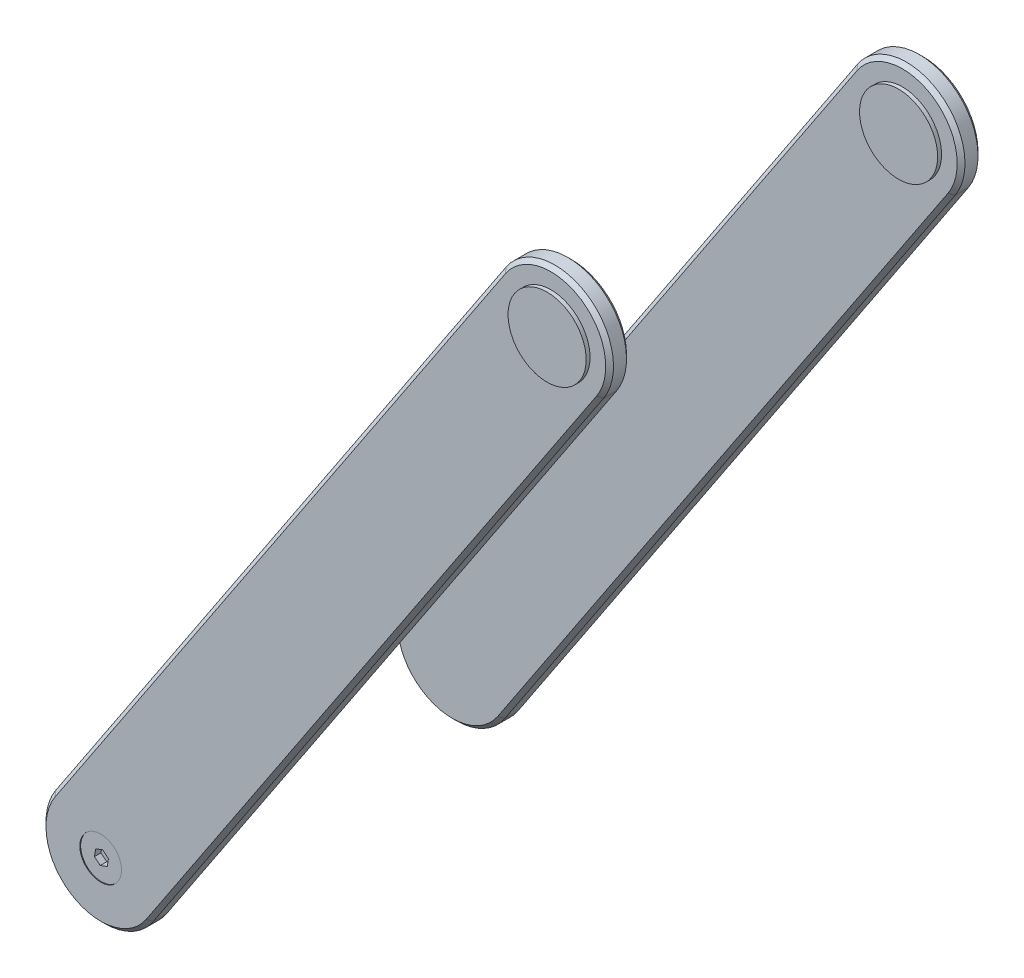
ISO-10303-21;
HEADER;
FILE_DESCRIPTION(('STEP AP214'),'2;1');
FILE_NAME('part.step','',(''),(''),'','','');
FILE_SCHEMA(('AUTOMOTIVE_DESIGN { 1 0 10303 214 1 1 1 1 }'));
ENDSEC;
DATA;
#1=APPLICATION_CONTEXT('core data for automotive mechanical design processes');
#2=APPLICATION_PROTOCOL_DEFINITION('international standard','automotive_design',2000,#1);
#3=PRODUCT_CONTEXT('',#1,'mechanical');
#4=PRODUCT('Part','Part','',(#3));
#5=PRODUCT_RELATED_PRODUCT_CATEGORY('part','',(#4));
#6=PRODUCT_DEFINITION_FORMATION('','',#4);
#7=PRODUCT_DEFINITION_CONTEXT('part definition',#1,'design');
#8=PRODUCT_DEFINITION('design','',#6,#7);
#9=PRODUCT_DEFINITION_SHAPE('','',#8);
#10=(LENGTH_UNIT() NAMED_UNIT(*) SI_UNIT(.MILLI.,.METRE.));
#11=(NAMED_UNIT(*) PLANE_ANGLE_UNIT() SI_UNIT($,.RADIAN.));
#12=(NAMED_UNIT(*) SI_UNIT($,.STERADIAN.) SOLID_ANGLE_UNIT());
#13=UNCERTAINTY_MEASURE_WITH_UNIT(LENGTH_MEASURE(1.E-05),#10,'distance_accuracy_value','');
#14=(GEOMETRIC_REPRESENTATION_CONTEXT(3) GLOBAL_UNCERTAINTY_ASSIGNED_CONTEXT((#13)) GLOBAL_UNIT_ASSIGNED_CONTEXT((#10,
#11,#12)) REPRESENTATION_CONTEXT('',''));
#15=CARTESIAN_POINT('',(0.,0.,0.));
#16=DIRECTION('',(0.,0.,1.));
#17=DIRECTION('',(1.,0.,0.));
#18=AXIS2_PLACEMENT_3D('',#15,#16,#17);
#19=CARTESIAN_POINT('',(156.227917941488,-635.393850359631,71.5));
#20=DIRECTION('',(0.,0.,-1.));
#21=DIRECTION('',(-0.553123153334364,-0.833099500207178,0.));
#22=AXIS2_PLACEMENT_3D('',#19,#20,#21);
#23=PLANE('',#22);
#24=CARTESIAN_POINT('',(329.186841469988,-374.887683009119,71.5));
#25=DIRECTION('',(0.,0.,1.));
#26=DIRECTION('',(-0.864548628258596,-0.502549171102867,0.));
#27=AXIS2_PLACEMENT_3D('',#24,#25,#26);
#28=CIRCLE('',#27,15.);
#29=CARTESIAN_POINT('',(316.218612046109,-382.425920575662,71.5));
#30=VERTEX_POINT('',#29);
#31=EDGE_CURVE('P0_E11',#30,#30,#28,.T.);
#32=ORIENTED_EDGE('',*,*,#31,.F.);
#33=EDGE_LOOP('',(#32));
#34=FACE_BOUND('',#33,.T.);
#35=CARTESIAN_POINT('',(156.227917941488,-635.393850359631,71.5));
#36=DIRECTION('',(0.,0.,1.));
#37=DIRECTION('',(1.,0.,0.));
#38=AXIS2_PLACEMENT_3D('',#35,#36,#37);
#39=CIRCLE('',#38,8.00000000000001);
#40=CARTESIAN_POINT('',(164.227917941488,-635.393850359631,71.5));
#41=VERTEX_POINT('',#40);
#42=EDGE_CURVE('P0_E192',#41,#41,#39,.T.);
#43=ORIENTED_EDGE('',*,*,#42,.F.);
#44=EDGE_LOOP('',(#43));
#45=FACE_BOUND('',#44,.T.);
#46=CARTESIAN_POINT('',(156.227917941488,-635.393850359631,71.5));
#47=DIRECTION('',(0.,0.,-1.));
#48=DIRECTION('',(-0.553123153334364,-0.833099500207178,0.));
#49=AXIS2_PLACEMENT_3D('',#46,#47,#48);
#50=CIRCLE('',#49,20.9999999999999);
#51=CARTESIAN_POINT('',(138.732828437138,-623.778264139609,71.5));
#52=VERTEX_POINT('',#51);
#53=CARTESIAN_POINT('',(173.723007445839,-647.009436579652,71.5));
#54=VERTEX_POINT('',#53);
#55=EDGE_CURVE('P0_E265',#52,#54,#50,.F.);
#56=ORIENTED_EDGE('',*,*,#55,.T.);
#57=DIRECTION('',(0.553123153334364,0.833099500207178,0.));
#58=VECTOR('',#57,1.);
#59=CARTESIAN_POINT('',(346.681930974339,-386.50326922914,71.5));
#60=LINE('',#59,#58);
#61=CARTESIAN_POINT('',(346.681930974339,-386.50326922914,71.5));
#62=VERTEX_POINT('',#61);
#63=EDGE_CURVE('P0_E26',#54,#62,#60,.T.);
#64=ORIENTED_EDGE('',*,*,#63,.T.);
#65=CARTESIAN_POINT('',(329.186841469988,-374.887683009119,71.5));
#66=DIRECTION('',(0.,0.,-1.));
#67=DIRECTION('',(-0.553123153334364,-0.833099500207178,0.));
#68=AXIS2_PLACEMENT_3D('',#65,#66,#67);
#69=CIRCLE('',#68,20.9999999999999);
#70=CARTESIAN_POINT('',(311.691751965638,-363.272096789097,71.5));
#71=VERTEX_POINT('',#70);
#72=EDGE_CURVE('P0_E268',#62,#71,#69,.F.);
#73=ORIENTED_EDGE('',*,*,#72,.T.);
#74=DIRECTION('',(-0.553123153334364,-0.833099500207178,0.));
#75=VECTOR('',#74,1.);
#76=CARTESIAN_POINT('',(138.732828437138,-623.778264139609,71.5));
#77=LINE('',#76,#75);
#78=EDGE_CURVE('P0_E262',#71,#52,#77,.T.);
#79=ORIENTED_EDGE('',*,*,#78,.T.);
#80=EDGE_LOOP('',(#56,#64,#73,#79));
#81=FACE_BOUND('',#80,.T.);
#82=ADVANCED_FACE('P0_F16',(#34,#45,#81),#23,.F.);
#83=CARTESIAN_POINT('',(156.227917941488,-635.393850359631,71.5));
#84=DIRECTION('',(0.,0.,-1.));
#85=DIRECTION('',(-0.553123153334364,-0.833099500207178,0.));
#86=AXIS2_PLACEMENT_3D('',#83,#84,#85);
#87=CYLINDRICAL_SURFACE('',#86,22.5);
#88=DIRECTION('',(0.,0.,-1.));
#89=VECTOR('',#88,1.);
#90=CARTESIAN_POINT('',(137.483179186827,-622.948579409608,71.5));
#91=LINE('',#90,#89);
#92=CARTESIAN_POINT('',(137.483179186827,-622.948579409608,69.9999999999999));
#93=VERTEX_POINT('',#92);
#94=CARTESIAN_POINT('',(137.483179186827,-622.948579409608,65.));
#95=VERTEX_POINT('',#94);
#96=EDGE_CURVE('P0_E206',#93,#95,#91,.T.);
#97=ORIENTED_EDGE('',*,*,#96,.T.);
#98=CARTESIAN_POINT('',(156.227917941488,-635.393850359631,65.));
#99=DIRECTION('',(0.,0.,-1.));
#100=DIRECTION('',(-0.553123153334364,-0.833099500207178,0.));
#101=AXIS2_PLACEMENT_3D('',#98,#99,#100);
#102=CIRCLE('',#101,22.5);
#103=CARTESIAN_POINT('',(174.97265669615,-647.839121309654,65.));
#104=VERTEX_POINT('',#103);
#105=EDGE_CURVE('P0_E247',#95,#104,#102,.F.);
#106=ORIENTED_EDGE('',*,*,#105,.T.);
#107=DIRECTION('',(0.,0.,-1.));
#108=VECTOR('',#107,1.);
#109=CARTESIAN_POINT('',(174.97265669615,-647.839121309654,71.5));
#110=LINE('',#109,#108);
#111=CARTESIAN_POINT('',(174.97265669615,-647.839121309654,69.9999999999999));
#112=VERTEX_POINT('',#111);
#113=EDGE_CURVE('P0_E219',#112,#104,#110,.T.);
#114=ORIENTED_EDGE('',*,*,#113,.F.);
#115=CARTESIAN_POINT('',(156.227917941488,-635.393850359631,69.9999999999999));
#116=DIRECTION('',(0.,0.,-1.));
#117=DIRECTION('',(-0.553123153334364,-0.833099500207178,0.));
#118=AXIS2_PLACEMENT_3D('',#115,#116,#117);
#119=CIRCLE('',#118,22.5);
#120=EDGE_CURVE('P0_E244',#112,#93,#119,.T.);
#121=ORIENTED_EDGE('',*,*,#120,.T.);
#122=EDGE_LOOP('',(#97,#106,#114,#121));
#123=FACE_BOUND('',#122,.T.);
#124=ADVANCED_FACE('P0_F323',(#123),#87,.T.);
#125=CARTESIAN_POINT('',(137.483179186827,-622.948579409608,71.5));
#126=DIRECTION('',(0.833099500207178,-0.553123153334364,0.));
#127=DIRECTION('',(0.,0.,1.));
#128=AXIS2_PLACEMENT_3D('',#125,#126,#127);
#129=PLANE('',#128);
#130=DIRECTION('',(0.,0.,-1.));
#131=VECTOR('',#130,1.);
#132=CARTESIAN_POINT('',(310.442102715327,-362.442412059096,71.5));
#133=LINE('',#132,#131);
#134=CARTESIAN_POINT('',(310.442102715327,-362.442412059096,69.9999999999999));
#135=VERTEX_POINT('',#134);
#136=CARTESIAN_POINT('',(310.442102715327,-362.442412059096,65.));
#137=VERTEX_POINT('',#136);
#138=EDGE_CURVE('P0_E211',#135,#137,#133,.T.);
#139=ORIENTED_EDGE('',*,*,#138,.T.);
#140=DIRECTION('',(-0.553123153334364,-0.833099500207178,0.));
#141=VECTOR('',#140,1.);
#142=CARTESIAN_POINT('',(137.483179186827,-622.948579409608,65.));
#143=LINE('',#142,#141);
#144=EDGE_CURVE('P0_E259',#137,#95,#143,.T.);
#145=ORIENTED_EDGE('',*,*,#144,.T.);
#146=ORIENTED_EDGE('',*,*,#96,.F.);
#147=DIRECTION('',(0.553123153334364,0.833099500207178,0.));
#148=VECTOR('',#147,1.);
#149=CARTESIAN_POINT('',(137.483179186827,-622.948579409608,69.9999999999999));
#150=LINE('',#149,#148);
#151=EDGE_CURVE('P0_E256',#93,#135,#150,.T.);
#152=ORIENTED_EDGE('',*,*,#151,.T.);
#153=EDGE_LOOP('',(#139,#145,#146,#152));
#154=FACE_BOUND('',#153,.T.);
#155=ADVANCED_FACE('P0_F340',(#154),#129,.F.);
#156=CARTESIAN_POINT('',(329.186841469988,-374.887683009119,71.5));
#157=DIRECTION('',(0.,0.,-1.));
#158=DIRECTION('',(-0.553123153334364,-0.833099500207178,0.));
#159=AXIS2_PLACEMENT_3D('',#156,#157,#158);
#160=CYLINDRICAL_SURFACE('',#159,22.5);
#161=DIRECTION('',(0.,0.,-1.));
#162=VECTOR('',#161,1.);
#163=CARTESIAN_POINT('',(347.93158022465,-387.332953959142,71.5));
#164=LINE('',#163,#162);
#165=CARTESIAN_POINT('',(347.93158022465,-387.332953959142,69.9999999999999));
#166=VERTEX_POINT('',#165);
#167=CARTESIAN_POINT('',(347.93158022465,-387.332953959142,65.));
#168=VERTEX_POINT('',#167);
#169=EDGE_CURVE('P0_E215',#166,#168,#164,.T.);
#170=ORIENTED_EDGE('',*,*,#169,.T.);
#171=CARTESIAN_POINT('',(329.186841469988,-374.887683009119,65.));
#172=DIRECTION('',(0.,0.,-1.));
#173=DIRECTION('',(-0.553123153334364,-0.833099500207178,0.));
#174=AXIS2_PLACEMENT_3D('',#171,#172,#173);
#175=CIRCLE('',#174,22.5);
#176=EDGE_CURVE('P0_E253',#168,#137,#175,.F.);
#177=ORIENTED_EDGE('',*,*,#176,.T.);
#178=ORIENTED_EDGE('',*,*,#138,.F.);
#179=CARTESIAN_POINT('',(329.186841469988,-374.887683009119,69.9999999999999));
#180=DIRECTION('',(0.,0.,-1.));
#181=DIRECTION('',(-0.553123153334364,-0.833099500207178,0.));
#182=AXIS2_PLACEMENT_3D('',#179,#180,#181);
#183=CIRCLE('',#182,22.5);
#184=EDGE_CURVE('P0_E250',#135,#166,#183,.T.);
#185=ORIENTED_EDGE('',*,*,#184,.T.);
#186=EDGE_LOOP('',(#170,#177,#178,#185));
#187=FACE_BOUND('',#186,.T.);
#188=ADVANCED_FACE('P0_F336',(#187),#160,.T.);
#189=CARTESIAN_POINT('',(174.97265669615,-647.839121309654,71.5));
#190=DIRECTION('',(0.833099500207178,-0.553123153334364,0.));
#191=DIRECTION('',(0.,0.,1.));
#192=AXIS2_PLACEMENT_3D('',#189,#190,#191);
#193=PLANE('',#192);
#194=ORIENTED_EDGE('',*,*,#113,.T.);
#195=DIRECTION('',(0.553123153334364,0.833099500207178,0.));
#196=VECTOR('',#195,1.);
#197=CARTESIAN_POINT('',(174.97265669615,-647.839121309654,65.));
#198=LINE('',#197,#196);
#199=EDGE_CURVE('P0_E240',#104,#168,#198,.T.);
#200=ORIENTED_EDGE('',*,*,#199,.T.);
#201=ORIENTED_EDGE('',*,*,#169,.F.);
#202=DIRECTION('',(-0.553123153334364,-0.833099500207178,0.));
#203=VECTOR('',#202,1.);
#204=CARTESIAN_POINT('',(174.97265669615,-647.839121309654,69.9999999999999));
#205=LINE('',#204,#203);
#206=EDGE_CURVE('P0_E236',#166,#112,#205,.T.);
#207=ORIENTED_EDGE('',*,*,#206,.T.);
#208=EDGE_LOOP('',(#194,#200,#201,#207));
#209=FACE_BOUND('',#208,.T.);
#210=ADVANCED_FACE('P0_F321',(#209),#193,.T.);
#211=CARTESIAN_POINT('',(156.227917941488,-635.393850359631,63.5));
#212=DIRECTION('',(0.,0.,-1.));
#213=DIRECTION('',(-0.553123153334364,-0.833099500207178,0.));
#214=AXIS2_PLACEMENT_3D('',#211,#212,#213);
#215=PLANE('',#214);
#216=CARTESIAN_POINT('',(329.186841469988,-374.887683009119,63.5));
#217=DIRECTION('',(0.,0.,1.));
#218=DIRECTION('',(0.95561398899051,0.294621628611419,0.));
#219=AXIS2_PLACEMENT_3D('',#216,#217,#218);
#220=CIRCLE('',#219,15.);
#221=CARTESIAN_POINT('',(314.852631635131,-379.30700743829,63.5));
#222=VERTEX_POINT('',#221);
#223=EDGE_CURVE('P0_E483',#222,#222,#220,.T.);
#224=ORIENTED_EDGE('',*,*,#223,.T.);
#225=EDGE_LOOP('',(#224));
#226=FACE_BOUND('',#225,.T.);
#227=CARTESIAN_POINT('',(329.186841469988,-374.887683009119,63.5));
#228=DIRECTION('',(0.,0.,-1.));
#229=DIRECTION('',(-0.553123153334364,-0.833099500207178,0.));
#230=AXIS2_PLACEMENT_3D('',#227,#228,#229);
#231=CIRCLE('',#230,20.9999999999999);
#232=CARTESIAN_POINT('',(311.691751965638,-363.272096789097,63.5));
#233=VERTEX_POINT('',#232);
#234=CARTESIAN_POINT('',(346.681930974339,-386.50326922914,63.5));
#235=VERTEX_POINT('',#234);
#236=EDGE_CURVE('P0_E226',#233,#235,#231,.T.);
#237=ORIENTED_EDGE('',*,*,#236,.T.);
#238=DIRECTION('',(-0.553123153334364,-0.833099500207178,0.));
#239=VECTOR('',#238,1.);
#240=CARTESIAN_POINT('',(173.723007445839,-647.009436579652,63.5));
#241=LINE('',#240,#239);
#242=CARTESIAN_POINT('',(173.723007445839,-647.009436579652,63.5));
#243=VERTEX_POINT('',#242);
#244=EDGE_CURVE('P0_E232',#235,#243,#241,.T.);
#245=ORIENTED_EDGE('',*,*,#244,.T.);
#246=CARTESIAN_POINT('',(156.227917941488,-635.393850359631,63.5));
#247=DIRECTION('',(0.,0.,-1.));
#248=DIRECTION('',(-0.553123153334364,-0.833099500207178,0.));
#249=AXIS2_PLACEMENT_3D('',#246,#247,#248);
#250=CIRCLE('',#249,20.9999999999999);
#251=CARTESIAN_POINT('',(138.732828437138,-623.778264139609,63.5));
#252=VERTEX_POINT('',#251);
#253=EDGE_CURVE('P0_E229',#243,#252,#250,.T.);
#254=ORIENTED_EDGE('',*,*,#253,.T.);
#255=DIRECTION('',(0.553123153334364,0.833099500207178,0.));
#256=VECTOR('',#255,1.);
#257=CARTESIAN_POINT('',(311.691751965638,-363.272096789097,63.5));
#258=LINE('',#257,#256);
#259=EDGE_CURVE('P0_E210',#252,#233,#258,.T.);
#260=ORIENTED_EDGE('',*,*,#259,.T.);
#261=EDGE_LOOP('',(#237,#245,#254,#260));
#262=FACE_BOUND('',#261,.T.);
#263=ADVANCED_FACE('P0_F349',(#226,#262),#215,.T.);
#264=CARTESIAN_POINT('',(138.732828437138,-623.778264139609,63.5));
#265=DIRECTION('',(-0.589090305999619,0.391117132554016,-0.707106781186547));
#266=DIRECTION('',(-0.553123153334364,-0.833099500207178,0.));
#267=AXIS2_PLACEMENT_3D('',#264,#265,#266);
#268=PLANE('',#267);
#269=DIRECTION('',(0.589090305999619,-0.391117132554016,-0.707106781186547));
#270=VECTOR('',#269,1.);
#271=CARTESIAN_POINT('',(137.483179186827,-622.948579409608,65.));
#272=LINE('',#271,#270);
#273=EDGE_CURVE('P0_E280',#95,#252,#272,.T.);
#274=ORIENTED_EDGE('',*,*,#273,.F.);
#275=ORIENTED_EDGE('',*,*,#144,.F.);
#276=DIRECTION('',(-0.589090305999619,0.391117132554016,0.707106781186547));
#277=VECTOR('',#276,1.);
#278=CARTESIAN_POINT('',(311.691751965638,-363.272096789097,63.5));
#279=LINE('',#278,#277);
#280=EDGE_CURVE('P0_E223',#233,#137,#279,.T.);
#281=ORIENTED_EDGE('',*,*,#280,.F.);
#282=ORIENTED_EDGE('',*,*,#259,.F.);
#283=EDGE_LOOP('',(#274,#275,#281,#282));
#284=FACE_BOUND('',#283,.T.);
#285=ADVANCED_FACE('P0_F343',(#284),#268,.T.);
#286=CARTESIAN_POINT('',(329.186841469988,-374.887683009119,63.5));
#287=DIRECTION('',(0.,0.,1.));
#288=DIRECTION('',(0.553123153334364,0.833099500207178,0.));
#289=AXIS2_PLACEMENT_3D('',#286,#287,#288);
#290=CONICAL_SURFACE('',#289,20.9999999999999,0.785398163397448);
#291=ORIENTED_EDGE('',*,*,#280,.T.);
#292=ORIENTED_EDGE('',*,*,#176,.F.);
#293=DIRECTION('',(0.589090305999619,-0.391117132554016,0.707106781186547));
#294=VECTOR('',#293,1.);
#295=CARTESIAN_POINT('',(346.681930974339,-386.50326922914,63.5));
#296=LINE('',#295,#294);
#297=EDGE_CURVE('P0_E277',#235,#168,#296,.T.);
#298=ORIENTED_EDGE('',*,*,#297,.F.);
#299=ORIENTED_EDGE('',*,*,#236,.F.);
#300=EDGE_LOOP('',(#291,#292,#298,#299));
#301=FACE_BOUND('',#300,.T.);
#302=ADVANCED_FACE('P0_F347',(#301),#290,.T.);
#303=CARTESIAN_POINT('',(156.227917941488,-635.393850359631,63.5));
#304=DIRECTION('',(0.,0.,1.));
#305=DIRECTION('',(0.553123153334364,0.833099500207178,0.));
#306=AXIS2_PLACEMENT_3D('',#303,#304,#305);
#307=CONICAL_SURFACE('',#306,20.9999999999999,0.785398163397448);
#308=ORIENTED_EDGE('',*,*,#273,.T.);
#309=ORIENTED_EDGE('',*,*,#253,.F.);
#310=DIRECTION('',(-0.589090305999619,0.391117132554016,-0.707106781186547));
#311=VECTOR('',#310,1.);
#312=CARTESIAN_POINT('',(174.97265669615,-647.839121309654,65.));
#313=LINE('',#312,#311);
#314=EDGE_CURVE('P0_E274',#104,#243,#313,.T.);
#315=ORIENTED_EDGE('',*,*,#314,.F.);
#316=ORIENTED_EDGE('',*,*,#105,.F.);
#317=EDGE_LOOP('',(#308,#309,#315,#316));
#318=FACE_BOUND('',#317,.T.);
#319=ADVANCED_FACE('P0_F328',(#318),#307,.T.);
#320=CARTESIAN_POINT('',(173.723007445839,-647.009436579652,63.5));
#321=DIRECTION('',(-0.589090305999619,0.391117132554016,0.707106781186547));
#322=DIRECTION('',(-0.553123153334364,-0.833099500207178,0.));
#323=AXIS2_PLACEMENT_3D('',#320,#321,#322);
#324=PLANE('',#323);
#325=ORIENTED_EDGE('',*,*,#297,.T.);
#326=ORIENTED_EDGE('',*,*,#199,.F.);
#327=ORIENTED_EDGE('',*,*,#314,.T.);
#328=ORIENTED_EDGE('',*,*,#244,.F.);
#329=EDGE_LOOP('',(#325,#326,#327,#328));
#330=FACE_BOUND('',#329,.T.);
#331=ADVANCED_FACE('P0_F332',(#330),#324,.F.);
#332=CARTESIAN_POINT('',(138.732828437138,-623.778264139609,71.5));
#333=DIRECTION('',(0.589090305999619,-0.391117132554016,-0.707106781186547));
#334=DIRECTION('',(-0.553123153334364,-0.833099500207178,0.));
#335=AXIS2_PLACEMENT_3D('',#332,#333,#334);
#336=PLANE('',#335);
#337=DIRECTION('',(-0.589090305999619,0.391117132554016,-0.707106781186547));
#338=VECTOR('',#337,1.);
#339=CARTESIAN_POINT('',(138.732828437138,-623.778264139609,71.5));
#340=LINE('',#339,#338);
#341=EDGE_CURVE('P0_E290',#52,#93,#340,.T.);
#342=ORIENTED_EDGE('',*,*,#341,.F.);
#343=ORIENTED_EDGE('',*,*,#78,.F.);
#344=DIRECTION('',(0.589090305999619,-0.391117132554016,0.707106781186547));
#345=VECTOR('',#344,1.);
#346=CARTESIAN_POINT('',(310.442102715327,-362.442412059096,69.9999999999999));
#347=LINE('',#346,#345);
#348=EDGE_CURVE('P0_E20',#135,#71,#347,.T.);
#349=ORIENTED_EDGE('',*,*,#348,.F.);
#350=ORIENTED_EDGE('',*,*,#151,.F.);
#351=EDGE_LOOP('',(#342,#343,#349,#350));
#352=FACE_BOUND('',#351,.T.);
#353=ADVANCED_FACE('P0_F18',(#352),#336,.F.);
#354=CARTESIAN_POINT('',(329.186841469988,-374.887683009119,69.9999999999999));
#355=DIRECTION('',(0.,0.,-1.));
#356=DIRECTION('',(-0.553123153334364,-0.833099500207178,0.));
#357=AXIS2_PLACEMENT_3D('',#354,#355,#356);
#358=CONICAL_SURFACE('',#357,22.5,0.785398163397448);
#359=ORIENTED_EDGE('',*,*,#348,.T.);
#360=ORIENTED_EDGE('',*,*,#72,.F.);
#361=DIRECTION('',(-0.589090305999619,0.391117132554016,0.707106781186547));
#362=VECTOR('',#361,1.);
#363=CARTESIAN_POINT('',(347.93158022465,-387.332953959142,69.9999999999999));
#364=LINE('',#363,#362);
#365=EDGE_CURVE('P0_E47',#166,#62,#364,.T.);
#366=ORIENTED_EDGE('',*,*,#365,.F.);
#367=ORIENTED_EDGE('',*,*,#184,.F.);
#368=EDGE_LOOP('',(#359,#360,#366,#367));
#369=FACE_BOUND('',#368,.T.);
#370=ADVANCED_FACE('P0_F308',(#369),#358,.T.);
#371=CARTESIAN_POINT('',(156.227917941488,-635.393850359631,69.9999999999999));
#372=DIRECTION('',(0.,0.,-1.));
#373=DIRECTION('',(-0.553123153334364,-0.833099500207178,0.));
#374=AXIS2_PLACEMENT_3D('',#371,#372,#373);
#375=CONICAL_SURFACE('',#374,22.5,0.785398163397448);
#376=ORIENTED_EDGE('',*,*,#341,.T.);
#377=ORIENTED_EDGE('',*,*,#120,.F.);
#378=DIRECTION('',(0.589090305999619,-0.391117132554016,-0.707106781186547));
#379=VECTOR('',#378,1.);
#380=CARTESIAN_POINT('',(173.723007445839,-647.009436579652,71.5));
#381=LINE('',#380,#379);
#382=EDGE_CURVE('P0_E203',#54,#112,#381,.T.);
#383=ORIENTED_EDGE('',*,*,#382,.F.);
#384=ORIENTED_EDGE('',*,*,#55,.F.);
#385=EDGE_LOOP('',(#376,#377,#383,#384));
#386=FACE_BOUND('',#385,.T.);
#387=ADVANCED_FACE('P0_F315',(#386),#375,.T.);
#388=CARTESIAN_POINT('',(174.97265669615,-647.839121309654,69.9999999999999));
#389=DIRECTION('',(0.589090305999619,-0.391117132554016,0.707106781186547));
#390=DIRECTION('',(0.553123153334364,0.833099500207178,0.));
#391=AXIS2_PLACEMENT_3D('',#388,#389,#390);
#392=PLANE('',#391);
#393=ORIENTED_EDGE('',*,*,#365,.T.);
#394=ORIENTED_EDGE('',*,*,#63,.F.);
#395=ORIENTED_EDGE('',*,*,#382,.T.);
#396=ORIENTED_EDGE('',*,*,#206,.F.);
#397=EDGE_LOOP('',(#393,#394,#395,#396));
#398=FACE_BOUND('',#397,.T.);
#399=ADVANCED_FACE('P0_F314',(#398),#392,.T.);
#400=CARTESIAN_POINT('',(156.227917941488,-635.393850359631,71.2));
#401=DIRECTION('',(0.,0.,1.));
#402=DIRECTION('',(1.,0.,0.));
#403=AXIS2_PLACEMENT_3D('',#400,#401,#402);
#404=CYLINDRICAL_SURFACE('',#403,8.00000000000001);
#405=CARTESIAN_POINT('',(156.227917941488,-635.393850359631,71.2));
#406=DIRECTION('',(0.,0.,1.));
#407=DIRECTION('',(1.,0.,0.));
#408=AXIS2_PLACEMENT_3D('',#405,#406,#407);
#409=CIRCLE('',#408,8.00000000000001);
#410=CARTESIAN_POINT('',(164.227917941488,-635.393850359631,71.2));
#411=VERTEX_POINT('',#410);
#412=EDGE_CURVE('P0_E200',#411,#411,#409,.T.);
#413=ORIENTED_EDGE('',*,*,#412,.F.);
#414=EDGE_LOOP('',(#413));
#415=FACE_BOUND('',#414,.T.);
#416=ORIENTED_EDGE('',*,*,#42,.T.);
#417=EDGE_LOOP('',(#416));
#418=FACE_BOUND('',#417,.T.);
#419=ADVANCED_FACE('P0_F381',(#415,#418),#404,.F.);
#420=CARTESIAN_POINT('',(156.227917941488,-635.393850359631,71.2));
#421=DIRECTION('',(0.,0.,1.));
#422=DIRECTION('',(1.,0.,0.));
#423=AXIS2_PLACEMENT_3D('',#420,#421,#422);
#424=PLANE('',#423);
#425=DIRECTION('',(-0.93544258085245,-0.353478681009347,0.));
#426=VECTOR('',#425,1.);
#427=CARTESIAN_POINT('',(156.694416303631,-632.545041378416,71.2));
#428=LINE('',#427,#426);
#429=CARTESIAN_POINT('',(156.694416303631,-632.545041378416,71.2));
#430=VERTEX_POINT('',#429);
#431=CARTESIAN_POINT('',(153.994026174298,-633.565446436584,71.2));
#432=VERTEX_POINT('',#431);
#433=EDGE_CURVE('P0_E148',#430,#432,#428,.T.);
#434=ORIENTED_EDGE('',*,*,#433,.F.);
#435=DIRECTION('',(-0.773842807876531,0.633377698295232,0.));
#436=VECTOR('',#435,1.);
#437=CARTESIAN_POINT('',(158.928308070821,-634.373445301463,71.2));
#438=LINE('',#437,#436);
#439=CARTESIAN_POINT('',(158.928308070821,-634.373445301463,71.2));
#440=VERTEX_POINT('',#439);
#441=EDGE_CURVE('P0_E166',#440,#430,#438,.T.);
#442=ORIENTED_EDGE('',*,*,#441,.F.);
#443=DIRECTION('',(0.161599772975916,0.986856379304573,0.));
#444=VECTOR('',#443,1.);
#445=CARTESIAN_POINT('',(158.461809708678,-637.222254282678,71.2));
#446=LINE('',#445,#444);
#447=CARTESIAN_POINT('',(158.461809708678,-637.222254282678,71.2));
#448=VERTEX_POINT('',#447);
#449=EDGE_CURVE('P0_E34',#448,#440,#446,.T.);
#450=ORIENTED_EDGE('',*,*,#449,.F.);
#451=DIRECTION('',(0.935442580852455,0.353478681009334,0.));
#452=VECTOR('',#451,1.);
#453=CARTESIAN_POINT('',(155.761419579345,-638.242659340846,71.2));
#454=LINE('',#453,#452);
#455=CARTESIAN_POINT('',(155.761419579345,-638.242659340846,71.2));
#456=VERTEX_POINT('',#455);
#457=EDGE_CURVE('P0_E186',#456,#448,#454,.T.);
#458=ORIENTED_EDGE('',*,*,#457,.F.);
#459=DIRECTION('',(0.773842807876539,-0.633377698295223,0.));
#460=VECTOR('',#459,1.);
#461=CARTESIAN_POINT('',(153.527527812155,-636.414255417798,71.2));
#462=LINE('',#461,#460);
#463=CARTESIAN_POINT('',(153.527527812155,-636.414255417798,71.2));
#464=VERTEX_POINT('',#463);
#465=EDGE_CURVE('P0_E183',#464,#456,#462,.T.);
#466=ORIENTED_EDGE('',*,*,#465,.F.);
#467=DIRECTION('',(-0.16159977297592,-0.986856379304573,0.));
#468=VECTOR('',#467,1.);
#469=CARTESIAN_POINT('',(153.994026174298,-633.565446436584,71.2));
#470=LINE('',#469,#468);
#471=EDGE_CURVE('P0_E180',#432,#464,#470,.T.);
#472=ORIENTED_EDGE('',*,*,#471,.F.);
#473=EDGE_LOOP('',(#434,#442,#450,#458,#466,#472));
#474=FACE_BOUND('',#473,.T.);
#475=ORIENTED_EDGE('',*,*,#412,.T.);
#476=EDGE_LOOP('',(#475));
#477=FACE_BOUND('',#476,.T.);
#478=ADVANCED_FACE('P0_F615',(#474,#477),#424,.T.);
#479=CARTESIAN_POINT('',(156.694416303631,-632.545041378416,68.7));
#480=DIRECTION('',(-0.353478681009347,0.93544258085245,0.));
#481=DIRECTION('',(-0.93544258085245,-0.353478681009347,0.));
#482=AXIS2_PLACEMENT_3D('',#479,#480,#481);
#483=PLANE('',#482);
#484=ORIENTED_EDGE('',*,*,#433,.T.);
#485=DIRECTION('',(0.,0.,1.));
#486=VECTOR('',#485,1.);
#487=CARTESIAN_POINT('',(153.994026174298,-633.565446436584,68.7));
#488=LINE('',#487,#486);
#489=CARTESIAN_POINT('',(153.994026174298,-633.565446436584,68.7));
#490=VERTEX_POINT('',#489);
#491=EDGE_CURVE('P0_E141',#490,#432,#488,.T.);
#492=ORIENTED_EDGE('',*,*,#491,.F.);
#493=DIRECTION('',(-0.93544258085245,-0.353478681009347,0.));
#494=VECTOR('',#493,1.);
#495=CARTESIAN_POINT('',(156.694416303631,-632.545041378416,68.7));
#496=LINE('',#495,#494);
#497=CARTESIAN_POINT('',(156.694416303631,-632.545041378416,68.7));
#498=VERTEX_POINT('',#497);
#499=EDGE_CURVE('P0_E145',#498,#490,#496,.T.);
#500=ORIENTED_EDGE('',*,*,#499,.F.);
#501=DIRECTION('',(0.,0.,1.));
#502=VECTOR('',#501,1.);
#503=CARTESIAN_POINT('',(156.694416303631,-632.545041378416,68.7));
#504=LINE('',#503,#502);
#505=EDGE_CURVE('P0_E190',#498,#430,#504,.T.);
#506=ORIENTED_EDGE('',*,*,#505,.T.);
#507=EDGE_LOOP('',(#484,#492,#500,#506));
#508=FACE_BOUND('',#507,.T.);
#509=ADVANCED_FACE('P0_F143',(#508),#483,.F.);
#510=CARTESIAN_POINT('',(158.928308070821,-634.373445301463,68.7));
#511=DIRECTION('',(0.633377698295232,0.773842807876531,0.));
#512=DIRECTION('',(-0.773842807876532,0.633377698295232,0.));
#513=AXIS2_PLACEMENT_3D('',#510,#511,#512);
#514=PLANE('',#513);
#515=ORIENTED_EDGE('',*,*,#441,.T.);
#516=ORIENTED_EDGE('',*,*,#505,.F.);
#517=DIRECTION('',(-0.773842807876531,0.633377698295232,0.));
#518=VECTOR('',#517,1.);
#519=CARTESIAN_POINT('',(158.928308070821,-634.373445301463,68.7));
#520=LINE('',#519,#518);
#521=CARTESIAN_POINT('',(158.928308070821,-634.373445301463,68.7));
#522=VERTEX_POINT('',#521);
#523=EDGE_CURVE('P0_E153',#522,#498,#520,.T.);
#524=ORIENTED_EDGE('',*,*,#523,.F.);
#525=DIRECTION('',(0.,0.,1.));
#526=VECTOR('',#525,1.);
#527=CARTESIAN_POINT('',(158.928308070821,-634.373445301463,68.7));
#528=LINE('',#527,#526);
#529=EDGE_CURVE('P0_E193',#522,#440,#528,.T.);
#530=ORIENTED_EDGE('',*,*,#529,.T.);
#531=EDGE_LOOP('',(#515,#516,#524,#530));
#532=FACE_BOUND('',#531,.T.);
#533=ADVANCED_FACE('P0_F597',(#532),#514,.F.);
#534=CARTESIAN_POINT('',(158.461809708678,-637.222254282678,68.7));
#535=DIRECTION('',(0.986856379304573,-0.161599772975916,0.));
#536=DIRECTION('',(0.161599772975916,0.986856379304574,0.));
#537=AXIS2_PLACEMENT_3D('',#534,#535,#536);
#538=PLANE('',#537);
#539=ORIENTED_EDGE('',*,*,#449,.T.);
#540=ORIENTED_EDGE('',*,*,#529,.F.);
#541=DIRECTION('',(0.161599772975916,0.986856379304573,0.));
#542=VECTOR('',#541,1.);
#543=CARTESIAN_POINT('',(158.461809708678,-637.222254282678,68.7));
#544=LINE('',#543,#542);
#545=CARTESIAN_POINT('',(158.461809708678,-637.222254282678,68.7));
#546=VERTEX_POINT('',#545);
#547=EDGE_CURVE('P0_E176',#546,#522,#544,.T.);
#548=ORIENTED_EDGE('',*,*,#547,.F.);
#549=DIRECTION('',(0.,0.,1.));
#550=VECTOR('',#549,1.);
#551=CARTESIAN_POINT('',(158.461809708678,-637.222254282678,68.7));
#552=LINE('',#551,#550);
#553=EDGE_CURVE('P0_E195',#546,#448,#552,.T.);
#554=ORIENTED_EDGE('',*,*,#553,.T.);
#555=EDGE_LOOP('',(#539,#540,#548,#554));
#556=FACE_BOUND('',#555,.T.);
#557=ADVANCED_FACE('P0_F587',(#556),#538,.F.);
#558=CARTESIAN_POINT('',(155.761419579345,-638.242659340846,68.7));
#559=DIRECTION('',(0.353478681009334,-0.935442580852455,0.));
#560=DIRECTION('',(0.935442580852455,0.353478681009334,0.));
#561=AXIS2_PLACEMENT_3D('',#558,#559,#560);
#562=PLANE('',#561);
#563=ORIENTED_EDGE('',*,*,#457,.T.);
#564=ORIENTED_EDGE('',*,*,#553,.F.);
#565=DIRECTION('',(0.935442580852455,0.353478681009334,0.));
#566=VECTOR('',#565,1.);
#567=CARTESIAN_POINT('',(155.761419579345,-638.242659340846,68.7));
#568=LINE('',#567,#566);
#569=CARTESIAN_POINT('',(155.761419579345,-638.242659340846,68.7));
#570=VERTEX_POINT('',#569);
#571=EDGE_CURVE('P0_E173',#570,#546,#568,.T.);
#572=ORIENTED_EDGE('',*,*,#571,.F.);
#573=DIRECTION('',(0.,0.,1.));
#574=VECTOR('',#573,1.);
#575=CARTESIAN_POINT('',(155.761419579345,-638.242659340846,68.7));
#576=LINE('',#575,#574);
#577=EDGE_CURVE('P0_E197',#570,#456,#576,.T.);
#578=ORIENTED_EDGE('',*,*,#577,.T.);
#579=EDGE_LOOP('',(#563,#564,#572,#578));
#580=FACE_BOUND('',#579,.T.);
#581=ADVANCED_FACE('P0_F577',(#580),#562,.F.);
#582=CARTESIAN_POINT('',(153.527527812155,-636.414255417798,68.7));
#583=DIRECTION('',(-0.633377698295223,-0.773842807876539,0.));
#584=DIRECTION('',(0.773842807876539,-0.633377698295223,0.));
#585=AXIS2_PLACEMENT_3D('',#582,#583,#584);
#586=PLANE('',#585);
#587=ORIENTED_EDGE('',*,*,#465,.T.);
#588=ORIENTED_EDGE('',*,*,#577,.F.);
#589=DIRECTION('',(0.773842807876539,-0.633377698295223,0.));
#590=VECTOR('',#589,1.);
#591=CARTESIAN_POINT('',(153.527527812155,-636.414255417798,68.7));
#592=LINE('',#591,#590);
#593=CARTESIAN_POINT('',(153.527527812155,-636.414255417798,68.7));
#594=VERTEX_POINT('',#593);
#595=EDGE_CURVE('P0_E161',#594,#570,#592,.T.);
#596=ORIENTED_EDGE('',*,*,#595,.F.);
#597=DIRECTION('',(0.,0.,1.));
#598=VECTOR('',#597,1.);
#599=CARTESIAN_POINT('',(153.527527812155,-636.414255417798,68.7));
#600=LINE('',#599,#598);
#601=EDGE_CURVE('P0_E152',#594,#464,#600,.T.);
#602=ORIENTED_EDGE('',*,*,#601,.T.);
#603=EDGE_LOOP('',(#587,#588,#596,#602));
#604=FACE_BOUND('',#603,.T.);
#605=ADVANCED_FACE('P0_F568',(#604),#586,.F.);
#606=CARTESIAN_POINT('',(153.994026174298,-633.565446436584,68.7));
#607=DIRECTION('',(-0.986856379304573,0.16159977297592,0.));
#608=DIRECTION('',(-0.16159977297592,-0.986856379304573,0.));
#609=AXIS2_PLACEMENT_3D('',#606,#607,#608);
#610=PLANE('',#609);
#611=ORIENTED_EDGE('',*,*,#471,.T.);
#612=ORIENTED_EDGE('',*,*,#601,.F.);
#613=DIRECTION('',(-0.16159977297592,-0.986856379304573,0.));
#614=VECTOR('',#613,1.);
#615=CARTESIAN_POINT('',(153.994026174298,-633.565446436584,68.7));
#616=LINE('',#615,#614);
#617=EDGE_CURVE('P0_E156',#490,#594,#616,.T.);
#618=ORIENTED_EDGE('',*,*,#617,.F.);
#619=ORIENTED_EDGE('',*,*,#491,.T.);
#620=EDGE_LOOP('',(#611,#612,#618,#619));
#621=FACE_BOUND('',#620,.T.);
#622=ADVANCED_FACE('P0_F157',(#621),#610,.F.);
#623=CARTESIAN_POINT('',(0.,0.,68.7));
#624=DIRECTION('',(0.,0.,1.));
#625=DIRECTION('',(1.,0.,0.));
#626=AXIS2_PLACEMENT_3D('',#623,#624,#625);
#627=PLANE('',#626);
#628=ORIENTED_EDGE('',*,*,#499,.T.);
#629=ORIENTED_EDGE('',*,*,#617,.T.);
#630=ORIENTED_EDGE('',*,*,#595,.T.);
#631=ORIENTED_EDGE('',*,*,#571,.T.);
#632=ORIENTED_EDGE('',*,*,#547,.T.);
#633=ORIENTED_EDGE('',*,*,#523,.T.);
#634=EDGE_LOOP('',(#628,#629,#630,#631,#632,#633));
#635=FACE_BOUND('',#634,.T.);
#636=ADVANCED_FACE('P0_F163',(#635),#627,.T.);
#637=CARTESIAN_POINT('',(329.186841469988,-374.887683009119,73.));
#638=DIRECTION('',(0.,0.,1.));
#639=DIRECTION('',(-0.864548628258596,-0.502549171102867,0.));
#640=AXIS2_PLACEMENT_3D('',#637,#638,#639);
#641=PLANE('',#640);
#642=CARTESIAN_POINT('',(329.186841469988,-374.887683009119,73.));
#643=DIRECTION('',(0.,0.,1.));
#644=DIRECTION('',(-0.864548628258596,-0.502549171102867,0.));
#645=AXIS2_PLACEMENT_3D('',#642,#643,#644);
#646=CIRCLE('',#645,15.);
#647=CARTESIAN_POINT('',(316.218612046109,-382.425920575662,73.));
#648=VERTEX_POINT('',#647);
#649=EDGE_CURVE('P0_E181',#648,#648,#646,.T.);
#650=ORIENTED_EDGE('',*,*,#649,.T.);
#651=EDGE_LOOP('',(#650));
#652=FACE_BOUND('',#651,.T.);
#653=ADVANCED_FACE('P0_F486',(#652),#641,.T.);
#654=CARTESIAN_POINT('',(329.186841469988,-374.887683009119,73.));
#655=DIRECTION('',(0.,0.,-1.));
#656=DIRECTION('',(0.864548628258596,0.502549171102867,0.));
#657=AXIS2_PLACEMENT_3D('',#654,#655,#656);
#658=CYLINDRICAL_SURFACE('',#657,15.);
#659=ORIENTED_EDGE('',*,*,#649,.F.);
#660=EDGE_LOOP('',(#659));
#661=FACE_BOUND('',#660,.T.);
#662=ORIENTED_EDGE('',*,*,#31,.T.);
#663=EDGE_LOOP('',(#662));
#664=FACE_BOUND('',#663,.T.);
#665=ADVANCED_FACE('P0_F490',(#661,#664),#658,.T.);
#666=CARTESIAN_POINT('',(329.186841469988,-374.887683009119,62.));
#667=DIRECTION('',(0.,0.,1.));
#668=DIRECTION('',(0.95561398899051,0.294621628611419,0.));
#669=AXIS2_PLACEMENT_3D('',#666,#667,#668);
#670=PLANE('',#669);
#671=CARTESIAN_POINT('',(329.186841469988,-374.887683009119,62.));
#672=DIRECTION('',(0.,0.,1.));
#673=DIRECTION('',(0.95561398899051,0.294621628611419,0.));
#674=AXIS2_PLACEMENT_3D('',#671,#672,#673);
#675=CIRCLE('',#674,15.);
#676=CARTESIAN_POINT('',(314.852631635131,-379.30700743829,62.));
#677=VERTEX_POINT('',#676);
#678=EDGE_CURVE('P0_E512',#677,#677,#675,.T.);
#679=ORIENTED_EDGE('',*,*,#678,.F.);
#680=EDGE_LOOP('',(#679));
#681=FACE_BOUND('',#680,.T.);
#682=ADVANCED_FACE('P0_F498',(#681),#670,.F.);
#683=CARTESIAN_POINT('',(329.186841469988,-374.887683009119,63.5));
#684=DIRECTION('',(0.,0.,-1.));
#685=DIRECTION('',(-0.95561398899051,-0.294621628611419,0.));
#686=AXIS2_PLACEMENT_3D('',#683,#684,#685);
#687=CYLINDRICAL_SURFACE('',#686,15.);
#688=CARTESIAN_POINT('',(314.852631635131,-379.30700743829,63.5));
#689=CARTESIAN_POINT('',(314.852631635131,-379.30700743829,63.484375));
#690=CARTESIAN_POINT('',(314.852631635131,-379.30700743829,63.46875));
#691=CARTESIAN_POINT('',(314.852631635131,-379.30700743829,63.4375));
#692=CARTESIAN_POINT('',(314.852631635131,-379.30700743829,63.421875));
#693=CARTESIAN_POINT('',(314.852631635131,-379.30700743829,63.390625));
#694=CARTESIAN_POINT('',(314.852631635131,-379.30700743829,63.375));
#695=CARTESIAN_POINT('',(314.852631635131,-379.30700743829,63.34375));
#696=CARTESIAN_POINT('',(314.852631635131,-379.30700743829,63.328125));
#697=CARTESIAN_POINT('',(314.852631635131,-379.30700743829,63.296875));
#698=CARTESIAN_POINT('',(314.852631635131,-379.30700743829,63.28125));
#699=CARTESIAN_POINT('',(314.852631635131,-379.30700743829,63.25));
#700=CARTESIAN_POINT('',(314.852631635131,-379.30700743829,63.234375));
#701=CARTESIAN_POINT('',(314.852631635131,-379.30700743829,63.203125));
#702=CARTESIAN_POINT('',(314.852631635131,-379.30700743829,63.1875));
#703=CARTESIAN_POINT('',(314.852631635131,-379.30700743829,63.15625));
#704=CARTESIAN_POINT('',(314.852631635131,-379.30700743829,63.140625));
#705=CARTESIAN_POINT('',(314.852631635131,-379.30700743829,63.109375));
#706=CARTESIAN_POINT('',(314.852631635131,-379.30700743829,63.09375));
#707=CARTESIAN_POINT('',(314.852631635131,-379.30700743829,63.0625));
#708=CARTESIAN_POINT('',(314.852631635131,-379.30700743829,63.046875));
#709=CARTESIAN_POINT('',(314.852631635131,-379.30700743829,63.015625));
#710=CARTESIAN_POINT('',(314.852631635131,-379.30700743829,63.));
#711=CARTESIAN_POINT('',(314.852631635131,-379.30700743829,62.96875));
#712=CARTESIAN_POINT('',(314.852631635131,-379.30700743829,62.953125));
#713=CARTESIAN_POINT('',(314.852631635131,-379.30700743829,62.921875));
#714=CARTESIAN_POINT('',(314.852631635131,-379.30700743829,62.90625));
#715=CARTESIAN_POINT('',(314.852631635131,-379.30700743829,62.875));
#716=CARTESIAN_POINT('',(314.852631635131,-379.30700743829,62.859375));
#717=CARTESIAN_POINT('',(314.852631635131,-379.30700743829,62.828125));
#718=CARTESIAN_POINT('',(314.852631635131,-379.30700743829,62.8125));
#719=CARTESIAN_POINT('',(314.852631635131,-379.30700743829,62.78125));
#720=CARTESIAN_POINT('',(314.852631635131,-379.30700743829,62.765625));
#721=CARTESIAN_POINT('',(314.852631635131,-379.30700743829,62.734375));
#722=CARTESIAN_POINT('',(314.852631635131,-379.30700743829,62.71875));
#723=CARTESIAN_POINT('',(314.852631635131,-379.30700743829,62.6875));
#724=CARTESIAN_POINT('',(314.852631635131,-379.30700743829,62.671875));
#725=CARTESIAN_POINT('',(314.852631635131,-379.30700743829,62.640625));
#726=CARTESIAN_POINT('',(314.852631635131,-379.30700743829,62.625));
#727=CARTESIAN_POINT('',(314.852631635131,-379.30700743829,62.59375));
#728=CARTESIAN_POINT('',(314.852631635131,-379.30700743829,62.578125));
#729=CARTESIAN_POINT('',(314.852631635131,-379.30700743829,62.546875));
#730=CARTESIAN_POINT('',(314.852631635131,-379.30700743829,62.53125));
#731=CARTESIAN_POINT('',(314.852631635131,-379.30700743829,62.5));
#732=CARTESIAN_POINT('',(314.852631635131,-379.30700743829,62.484375));
#733=CARTESIAN_POINT('',(314.852631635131,-379.30700743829,62.453125));
#734=CARTESIAN_POINT('',(314.852631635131,-379.30700743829,62.4375));
#735=CARTESIAN_POINT('',(314.852631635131,-379.30700743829,62.40625));
#736=CARTESIAN_POINT('',(314.852631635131,-379.30700743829,62.390625));
#737=CARTESIAN_POINT('',(314.852631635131,-379.30700743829,62.359375));
#738=CARTESIAN_POINT('',(314.852631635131,-379.30700743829,62.34375));
#739=CARTESIAN_POINT('',(314.852631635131,-379.30700743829,62.3125));
#740=CARTESIAN_POINT('',(314.852631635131,-379.30700743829,62.296875));
#741=CARTESIAN_POINT('',(314.852631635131,-379.30700743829,62.265625));
#742=CARTESIAN_POINT('',(314.852631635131,-379.30700743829,62.25));
#743=CARTESIAN_POINT('',(314.852631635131,-379.30700743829,62.21875));
#744=CARTESIAN_POINT('',(314.852631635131,-379.30700743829,62.203125));
#745=CARTESIAN_POINT('',(314.852631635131,-379.30700743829,62.171875));
#746=CARTESIAN_POINT('',(314.852631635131,-379.30700743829,62.15625));
#747=CARTESIAN_POINT('',(314.852631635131,-379.30700743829,62.125));
#748=CARTESIAN_POINT('',(314.852631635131,-379.30700743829,62.109375));
#749=CARTESIAN_POINT('',(314.852631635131,-379.30700743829,62.078125));
#750=CARTESIAN_POINT('',(314.852631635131,-379.30700743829,62.0625));
#751=CARTESIAN_POINT('',(314.852631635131,-379.30700743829,62.03125));
#752=CARTESIAN_POINT('',(314.852631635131,-379.30700743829,62.015625));
#753=CARTESIAN_POINT('',(314.852631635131,-379.30700743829,62.));
#754=B_SPLINE_CURVE_WITH_KNOTS('',3,(#688,#689,#690,#691,#692,#693,#694,#695,#696,#697,#698,
#699,#700,#701,#702,#703,#704,#705,#706,#707,#708,#709,#710,#711,#712,#713,#714,#715,#716,#717,
#718,#719,#720,#721,#722,#723,#724,#725,#726,#727,#728,#729,#730,#731,#732,#733,#734,#735,#736,
#737,#738,#739,#740,#741,#742,#743,#744,#745,#746,#747,#748,#749,#750,#751,#752,#753),
.UNSPECIFIED.,.F.,.F.,(4,2,2,2,2,2,2,2,2,2,2,2,2,2,2,2,2,2,2,2,2,2,2,2,2,2,2,2,2,2,2,2,4),(0.,
0.0468750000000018,0.0937500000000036,0.140625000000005,0.187500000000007,0.234375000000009,
0.281250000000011,0.328125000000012,0.375000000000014,0.421875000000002,0.468750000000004,
0.515625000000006,0.562500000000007,0.609375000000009,0.656250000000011,0.703125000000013,
0.750000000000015,0.796875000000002,0.843750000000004,0.890625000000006,0.937500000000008,
0.98437500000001,1.03125000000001,1.07812500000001,1.12500000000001,1.17187500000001,
1.21875000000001,1.26562500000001,1.31250000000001,1.35937500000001,1.40625000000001,
1.45312500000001,1.50000000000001),.UNSPECIFIED.);
#755=EDGE_CURVE('P0_BSEAM525',#222,#677,#754,.T.);
#756=ORIENTED_EDGE('',*,*,#223,.F.);
#757=ORIENTED_EDGE('',*,*,#678,.T.);
#758=ORIENTED_EDGE('',*,*,#755,.T.);
#759=ORIENTED_EDGE('',*,*,#755,.F.);
#760=EDGE_LOOP('',(#756,#758,#757,#759));
#761=FACE_BOUND('',#760,.T.);
#762=ADVANCED_FACE('P0_F525',(#761),#687,.T.);
#763=CLOSED_SHELL('',(#82,#124,#155,#188,#210,#263,#285,#302,#319,#331,#353,#370,#387,#399,#419,
#478,#509,#533,#557,#581,#605,#622,#636,#653,#665,#682,#762));
#764=MANIFOLD_SOLID_BREP('P0_B1',#763);
#765=CARTESIAN_POINT('',(156.227917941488,-635.393850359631,-71.5));
#766=DIRECTION('',(0.,0.,1.));
#767=DIRECTION('',(-0.553123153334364,-0.833099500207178,0.));
#768=AXIS2_PLACEMENT_3D('',#765,#766,#767);
#769=PLANE('',#768);
#770=CARTESIAN_POINT('',(329.186841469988,-374.887683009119,-71.5));
#771=DIRECTION('',(0.,0.,1.));
#772=DIRECTION('',(-0.864548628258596,-0.502549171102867,0.));
#773=AXIS2_PLACEMENT_3D('',#770,#771,#772);
#774=CIRCLE('',#773,15.);
#775=CARTESIAN_POINT('',(316.218612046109,-382.425920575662,-71.5));
#776=VERTEX_POINT('',#775);
#777=EDGE_CURVE('P1_E182',#776,#776,#774,.T.);
#778=ORIENTED_EDGE('',*,*,#777,.T.);
#779=EDGE_LOOP('',(#778));
#780=FACE_BOUND('',#779,.T.);
#781=CARTESIAN_POINT('',(156.227917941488,-635.393850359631,-71.5));
#782=DIRECTION('',(0.,0.,-1.));
#783=DIRECTION('',(0.,1.,0.));
#784=AXIS2_PLACEMENT_3D('',#781,#782,#783);
#785=CIRCLE('',#784,8.00000000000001);
#786=CARTESIAN_POINT('',(156.227917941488,-627.393850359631,-71.5));
#787=VERTEX_POINT('',#786);
#788=EDGE_CURVE('P1_E193',#787,#787,#785,.T.);
#789=ORIENTED_EDGE('',*,*,#788,.F.);
#790=EDGE_LOOP('',(#789));
#791=FACE_BOUND('',#790,.T.);
#792=CARTESIAN_POINT('',(156.227917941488,-635.393850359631,-71.5));
#793=DIRECTION('',(0.,0.,1.));
#794=DIRECTION('',(-0.553123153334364,-0.833099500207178,0.));
#795=AXIS2_PLACEMENT_3D('',#792,#793,#794);
#796=CIRCLE('',#795,20.9999999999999);
#797=CARTESIAN_POINT('',(173.723007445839,-647.009436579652,-71.5));
#798=VERTEX_POINT('',#797);
#799=CARTESIAN_POINT('',(138.732828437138,-623.778264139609,-71.5));
#800=VERTEX_POINT('',#799);
#801=EDGE_CURVE('P1_E266',#798,#800,#796,.F.);
#802=ORIENTED_EDGE('',*,*,#801,.T.);
#803=DIRECTION('',(0.553123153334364,0.833099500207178,0.));
#804=VECTOR('',#803,1.);
#805=CARTESIAN_POINT('',(311.691751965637,-363.272096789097,-71.5));
#806=LINE('',#805,#804);
#807=CARTESIAN_POINT('',(311.691751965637,-363.272096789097,-71.5));
#808=VERTEX_POINT('',#807);
#809=EDGE_CURVE('P1_E25',#800,#808,#806,.T.);
#810=ORIENTED_EDGE('',*,*,#809,.T.);
#811=CARTESIAN_POINT('',(329.186841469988,-374.887683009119,-71.5));
#812=DIRECTION('',(0.,0.,1.));
#813=DIRECTION('',(-0.553123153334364,-0.833099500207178,0.));
#814=AXIS2_PLACEMENT_3D('',#811,#812,#813);
#815=CIRCLE('',#814,20.9999999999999);
#816=CARTESIAN_POINT('',(346.681930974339,-386.50326922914,-71.5));
#817=VERTEX_POINT('',#816);
#818=EDGE_CURVE('P1_E269',#808,#817,#815,.F.);
#819=ORIENTED_EDGE('',*,*,#818,.T.);
#820=DIRECTION('',(-0.553123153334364,-0.833099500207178,0.));
#821=VECTOR('',#820,1.);
#822=CARTESIAN_POINT('',(173.723007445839,-647.009436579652,-71.5));
#823=LINE('',#822,#821);
#824=EDGE_CURVE('P1_E263',#817,#798,#823,.T.);
#825=ORIENTED_EDGE('',*,*,#824,.T.);
#826=EDGE_LOOP('',(#802,#810,#819,#825));
#827=FACE_BOUND('',#826,.T.);
#828=ADVANCED_FACE('P1_F15',(#780,#791,#827),#769,.F.);
#829=CARTESIAN_POINT('',(156.227917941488,-635.393850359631,-71.5));
#830=DIRECTION('',(0.,0.,1.));
#831=DIRECTION('',(-0.553123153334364,-0.833099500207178,0.));
#832=AXIS2_PLACEMENT_3D('',#829,#830,#831);
#833=CYLINDRICAL_SURFACE('',#832,22.5);
#834=DIRECTION('',(0.,0.,1.));
#835=VECTOR('',#834,1.);
#836=CARTESIAN_POINT('',(174.97265669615,-647.839121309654,-71.5));
#837=LINE('',#836,#835);
#838=CARTESIAN_POINT('',(174.97265669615,-647.839121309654,-70.));
#839=VERTEX_POINT('',#838);
#840=CARTESIAN_POINT('',(174.97265669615,-647.839121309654,-65.0000000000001));
#841=VERTEX_POINT('',#840);
#842=EDGE_CURVE('P1_E207',#839,#841,#837,.T.);
#843=ORIENTED_EDGE('',*,*,#842,.T.);
#844=CARTESIAN_POINT('',(156.227917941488,-635.393850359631,-65.0000000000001));
#845=DIRECTION('',(0.,0.,1.));
#846=DIRECTION('',(-0.553123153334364,-0.833099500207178,0.));
#847=AXIS2_PLACEMENT_3D('',#844,#845,#846);
#848=CIRCLE('',#847,22.5);
#849=CARTESIAN_POINT('',(137.483179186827,-622.948579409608,-65.0000000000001));
#850=VERTEX_POINT('',#849);
#851=EDGE_CURVE('P1_E248',#841,#850,#848,.F.);
#852=ORIENTED_EDGE('',*,*,#851,.T.);
#853=DIRECTION('',(0.,0.,1.));
#854=VECTOR('',#853,1.);
#855=CARTESIAN_POINT('',(137.483179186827,-622.948579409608,-71.5));
#856=LINE('',#855,#854);
#857=CARTESIAN_POINT('',(137.483179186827,-622.948579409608,-70.));
#858=VERTEX_POINT('',#857);
#859=EDGE_CURVE('P1_E220',#858,#850,#856,.T.);
#860=ORIENTED_EDGE('',*,*,#859,.F.);
#861=CARTESIAN_POINT('',(156.227917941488,-635.393850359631,-70.));
#862=DIRECTION('',(0.,0.,1.));
#863=DIRECTION('',(-0.553123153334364,-0.833099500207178,0.));
#864=AXIS2_PLACEMENT_3D('',#861,#862,#863);
#865=CIRCLE('',#864,22.5);
#866=EDGE_CURVE('P1_E245',#858,#839,#865,.T.);
#867=ORIENTED_EDGE('',*,*,#866,.T.);
#868=EDGE_LOOP('',(#843,#852,#860,#867));
#869=FACE_BOUND('',#868,.T.);
#870=ADVANCED_FACE('P1_F324',(#869),#833,.T.);
#871=CARTESIAN_POINT('',(174.97265669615,-647.839121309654,-71.5));
#872=DIRECTION('',(-0.833099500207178,0.553123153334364,0.));
#873=DIRECTION('',(0.,0.,-1.));
#874=AXIS2_PLACEMENT_3D('',#871,#872,#873);
#875=PLANE('',#874);
#876=DIRECTION('',(0.,0.,1.));
#877=VECTOR('',#876,1.);
#878=CARTESIAN_POINT('',(347.93158022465,-387.332953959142,-71.5));
#879=LINE('',#878,#877);
#880=CARTESIAN_POINT('',(347.93158022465,-387.332953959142,-70.));
#881=VERTEX_POINT('',#880);
#882=CARTESIAN_POINT('',(347.93158022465,-387.332953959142,-65.0000000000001));
#883=VERTEX_POINT('',#882);
#884=EDGE_CURVE('P1_E212',#881,#883,#879,.T.);
#885=ORIENTED_EDGE('',*,*,#884,.T.);
#886=DIRECTION('',(-0.553123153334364,-0.833099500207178,0.));
#887=VECTOR('',#886,1.);
#888=CARTESIAN_POINT('',(174.97265669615,-647.839121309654,-65.0000000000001));
#889=LINE('',#888,#887);
#890=EDGE_CURVE('P1_E260',#883,#841,#889,.T.);
#891=ORIENTED_EDGE('',*,*,#890,.T.);
#892=ORIENTED_EDGE('',*,*,#842,.F.);
#893=DIRECTION('',(0.553123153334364,0.833099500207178,0.));
#894=VECTOR('',#893,1.);
#895=CARTESIAN_POINT('',(174.97265669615,-647.839121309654,-70.));
#896=LINE('',#895,#894);
#897=EDGE_CURVE('P1_E257',#839,#881,#896,.T.);
#898=ORIENTED_EDGE('',*,*,#897,.T.);
#899=EDGE_LOOP('',(#885,#891,#892,#898));
#900=FACE_BOUND('',#899,.T.);
#901=ADVANCED_FACE('P1_F341',(#900),#875,.F.);
#902=CARTESIAN_POINT('',(329.186841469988,-374.887683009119,-71.5));
#903=DIRECTION('',(0.,0.,1.));
#904=DIRECTION('',(-0.553123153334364,-0.833099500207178,0.));
#905=AXIS2_PLACEMENT_3D('',#902,#903,#904);
#906=CYLINDRICAL_SURFACE('',#905,22.5);
#907=DIRECTION('',(0.,0.,1.));
#908=VECTOR('',#907,1.);
#909=CARTESIAN_POINT('',(310.442102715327,-362.442412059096,-71.5));
#910=LINE('',#909,#908);
#911=CARTESIAN_POINT('',(310.442102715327,-362.442412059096,-70.));
#912=VERTEX_POINT('',#911);
#913=CARTESIAN_POINT('',(310.442102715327,-362.442412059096,-65.0000000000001));
#914=VERTEX_POINT('',#913);
#915=EDGE_CURVE('P1_E216',#912,#914,#910,.T.);
#916=ORIENTED_EDGE('',*,*,#915,.T.);
#917=CARTESIAN_POINT('',(329.186841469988,-374.887683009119,-65.0000000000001));
#918=DIRECTION('',(0.,0.,1.));
#919=DIRECTION('',(-0.553123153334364,-0.833099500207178,0.));
#920=AXIS2_PLACEMENT_3D('',#917,#918,#919);
#921=CIRCLE('',#920,22.5);
#922=EDGE_CURVE('P1_E254',#914,#883,#921,.F.);
#923=ORIENTED_EDGE('',*,*,#922,.T.);
#924=ORIENTED_EDGE('',*,*,#884,.F.);
#925=CARTESIAN_POINT('',(329.186841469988,-374.887683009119,-70.));
#926=DIRECTION('',(0.,0.,1.));
#927=DIRECTION('',(-0.553123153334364,-0.833099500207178,0.));
#928=AXIS2_PLACEMENT_3D('',#925,#926,#927);
#929=CIRCLE('',#928,22.5);
#930=EDGE_CURVE('P1_E251',#881,#912,#929,.T.);
#931=ORIENTED_EDGE('',*,*,#930,.T.);
#932=EDGE_LOOP('',(#916,#923,#924,#931));
#933=FACE_BOUND('',#932,.T.);
#934=ADVANCED_FACE('P1_F337',(#933),#906,.T.);
#935=CARTESIAN_POINT('',(137.483179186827,-622.948579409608,-71.5));
#936=DIRECTION('',(-0.833099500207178,0.553123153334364,0.));
#937=DIRECTION('',(0.,0.,-1.));
#938=AXIS2_PLACEMENT_3D('',#935,#936,#937);
#939=PLANE('',#938);
#940=ORIENTED_EDGE('',*,*,#859,.T.);
#941=DIRECTION('',(0.553123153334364,0.833099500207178,0.));
#942=VECTOR('',#941,1.);
#943=CARTESIAN_POINT('',(137.483179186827,-622.948579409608,-65.0000000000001));
#944=LINE('',#943,#942);
#945=EDGE_CURVE('P1_E241',#850,#914,#944,.T.);
#946=ORIENTED_EDGE('',*,*,#945,.T.);
#947=ORIENTED_EDGE('',*,*,#915,.F.);
#948=DIRECTION('',(-0.553123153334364,-0.833099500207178,0.));
#949=VECTOR('',#948,1.);
#950=CARTESIAN_POINT('',(137.483179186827,-622.948579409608,-70.));
#951=LINE('',#950,#949);
#952=EDGE_CURVE('P1_E237',#912,#858,#951,.T.);
#953=ORIENTED_EDGE('',*,*,#952,.T.);
#954=EDGE_LOOP('',(#940,#946,#947,#953));
#955=FACE_BOUND('',#954,.T.);
#956=ADVANCED_FACE('P1_F322',(#955),#939,.T.);
#957=CARTESIAN_POINT('',(156.227917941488,-635.393850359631,-63.5));
#958=DIRECTION('',(0.,0.,1.));
#959=DIRECTION('',(-0.553123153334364,-0.833099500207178,0.));
#960=AXIS2_PLACEMENT_3D('',#957,#958,#959);
#961=PLANE('',#960);
#962=CARTESIAN_POINT('',(329.186841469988,-374.887683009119,-63.5));
#963=DIRECTION('',(0.,0.,1.));
#964=DIRECTION('',(0.95561398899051,0.294621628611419,0.));
#965=AXIS2_PLACEMENT_3D('',#962,#963,#964);
#966=CIRCLE('',#965,15.);
#967=CARTESIAN_POINT('',(343.521051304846,-370.468358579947,-63.5));
#968=VERTEX_POINT('',#967);
#969=EDGE_CURVE('P1_E10',#968,#968,#966,.T.);
#970=ORIENTED_EDGE('',*,*,#969,.F.);
#971=EDGE_LOOP('',(#970));
#972=FACE_BOUND('',#971,.T.);
#973=CARTESIAN_POINT('',(329.186841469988,-374.887683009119,-63.5));
#974=DIRECTION('',(0.,0.,1.));
#975=DIRECTION('',(-0.553123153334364,-0.833099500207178,0.));
#976=AXIS2_PLACEMENT_3D('',#973,#974,#975);
#977=CIRCLE('',#976,20.9999999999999);
#978=CARTESIAN_POINT('',(346.681930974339,-386.50326922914,-63.5));
#979=VERTEX_POINT('',#978);
#980=CARTESIAN_POINT('',(311.691751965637,-363.272096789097,-63.5));
#981=VERTEX_POINT('',#980);
#982=EDGE_CURVE('P1_E227',#979,#981,#977,.T.);
#983=ORIENTED_EDGE('',*,*,#982,.T.);
#984=DIRECTION('',(-0.553123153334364,-0.833099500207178,0.));
#985=VECTOR('',#984,1.);
#986=CARTESIAN_POINT('',(138.732828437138,-623.778264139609,-63.5));
#987=LINE('',#986,#985);
#988=CARTESIAN_POINT('',(138.732828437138,-623.778264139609,-63.5));
#989=VERTEX_POINT('',#988);
#990=EDGE_CURVE('P1_E233',#981,#989,#987,.T.);
#991=ORIENTED_EDGE('',*,*,#990,.T.);
#992=CARTESIAN_POINT('',(156.227917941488,-635.393850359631,-63.5));
#993=DIRECTION('',(0.,0.,1.));
#994=DIRECTION('',(-0.553123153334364,-0.833099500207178,0.));
#995=AXIS2_PLACEMENT_3D('',#992,#993,#994);
#996=CIRCLE('',#995,20.9999999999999);
#997=CARTESIAN_POINT('',(173.723007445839,-647.009436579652,-63.5));
#998=VERTEX_POINT('',#997);
#999=EDGE_CURVE('P1_E230',#989,#998,#996,.T.);
#1000=ORIENTED_EDGE('',*,*,#999,.T.);
#1001=DIRECTION('',(0.553123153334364,0.833099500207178,0.));
#1002=VECTOR('',#1001,1.);
#1003=CARTESIAN_POINT('',(346.681930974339,-386.50326922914,-63.5));
#1004=LINE('',#1003,#1002);
#1005=EDGE_CURVE('P1_E211',#998,#979,#1004,.T.);
#1006=ORIENTED_EDGE('',*,*,#1005,.T.);
#1007=EDGE_LOOP('',(#983,#991,#1000,#1006));
#1008=FACE_BOUND('',#1007,.T.);
#1009=ADVANCED_FACE('P1_F350',(#972,#1008),#961,.T.);
#1010=CARTESIAN_POINT('',(173.723007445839,-647.009436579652,-63.5));
#1011=DIRECTION('',(0.589090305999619,-0.391117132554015,0.707106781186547));
#1012=DIRECTION('',(-0.553123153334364,-0.833099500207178,0.));
#1013=AXIS2_PLACEMENT_3D('',#1010,#1011,#1012);
#1014=PLANE('',#1013);
#1015=DIRECTION('',(-0.589090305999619,0.391117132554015,0.707106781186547));
#1016=VECTOR('',#1015,1.);
#1017=CARTESIAN_POINT('',(174.97265669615,-647.839121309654,-65.0000000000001));
#1018=LINE('',#1017,#1016);
#1019=EDGE_CURVE('P1_E281',#841,#998,#1018,.T.);
#1020=ORIENTED_EDGE('',*,*,#1019,.F.);
#1021=ORIENTED_EDGE('',*,*,#890,.F.);
#1022=DIRECTION('',(0.589090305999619,-0.391117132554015,-0.707106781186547));
#1023=VECTOR('',#1022,1.);
#1024=CARTESIAN_POINT('',(346.681930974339,-386.50326922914,-63.5));
#1025=LINE('',#1024,#1023);
#1026=EDGE_CURVE('P1_E224',#979,#883,#1025,.T.);
#1027=ORIENTED_EDGE('',*,*,#1026,.F.);
#1028=ORIENTED_EDGE('',*,*,#1005,.F.);
#1029=EDGE_LOOP('',(#1020,#1021,#1027,#1028));
#1030=FACE_BOUND('',#1029,.T.);
#1031=ADVANCED_FACE('P1_F344',(#1030),#1014,.T.);
#1032=CARTESIAN_POINT('',(329.186841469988,-374.887683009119,-63.5));
#1033=DIRECTION('',(0.,0.,-1.));
#1034=DIRECTION('',(0.553123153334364,0.833099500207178,0.));
#1035=AXIS2_PLACEMENT_3D('',#1032,#1033,#1034);
#1036=CONICAL_SURFACE('',#1035,20.9999999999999,0.785398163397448);
#1037=ORIENTED_EDGE('',*,*,#1026,.T.);
#1038=ORIENTED_EDGE('',*,*,#922,.F.);
#1039=DIRECTION('',(-0.589090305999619,0.391117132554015,-0.707106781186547));
#1040=VECTOR('',#1039,1.);
#1041=CARTESIAN_POINT('',(311.691751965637,-363.272096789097,-63.5));
#1042=LINE('',#1041,#1040);
#1043=EDGE_CURVE('P1_E278',#981,#914,#1042,.T.);
#1044=ORIENTED_EDGE('',*,*,#1043,.F.);
#1045=ORIENTED_EDGE('',*,*,#982,.F.);
#1046=EDGE_LOOP('',(#1037,#1038,#1044,#1045));
#1047=FACE_BOUND('',#1046,.T.);
#1048=ADVANCED_FACE('P1_F348',(#1047),#1036,.T.);
#1049=CARTESIAN_POINT('',(156.227917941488,-635.393850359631,-63.5));
#1050=DIRECTION('',(0.,0.,-1.));
#1051=DIRECTION('',(0.553123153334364,0.833099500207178,0.));
#1052=AXIS2_PLACEMENT_3D('',#1049,#1050,#1051);
#1053=CONICAL_SURFACE('',#1052,20.9999999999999,0.785398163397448);
#1054=ORIENTED_EDGE('',*,*,#1019,.T.);
#1055=ORIENTED_EDGE('',*,*,#999,.F.);
#1056=DIRECTION('',(0.589090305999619,-0.391117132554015,0.707106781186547));
#1057=VECTOR('',#1056,1.);
#1058=CARTESIAN_POINT('',(137.483179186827,-622.948579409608,-65.0000000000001));
#1059=LINE('',#1058,#1057);
#1060=EDGE_CURVE('P1_E275',#850,#989,#1059,.T.);
#1061=ORIENTED_EDGE('',*,*,#1060,.F.);
#1062=ORIENTED_EDGE('',*,*,#851,.F.);
#1063=EDGE_LOOP('',(#1054,#1055,#1061,#1062));
#1064=FACE_BOUND('',#1063,.T.);
#1065=ADVANCED_FACE('P1_F329',(#1064),#1053,.T.);
#1066=CARTESIAN_POINT('',(138.732828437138,-623.778264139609,-63.5));
#1067=DIRECTION('',(0.589090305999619,-0.391117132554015,-0.707106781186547));
#1068=DIRECTION('',(-0.553123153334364,-0.833099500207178,0.));
#1069=AXIS2_PLACEMENT_3D('',#1066,#1067,#1068);
#1070=PLANE('',#1069);
#1071=ORIENTED_EDGE('',*,*,#1043,.T.);
#1072=ORIENTED_EDGE('',*,*,#945,.F.);
#1073=ORIENTED_EDGE('',*,*,#1060,.T.);
#1074=ORIENTED_EDGE('',*,*,#990,.F.);
#1075=EDGE_LOOP('',(#1071,#1072,#1073,#1074));
#1076=FACE_BOUND('',#1075,.T.);
#1077=ADVANCED_FACE('P1_F333',(#1076),#1070,.F.);
#1078=CARTESIAN_POINT('',(173.723007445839,-647.009436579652,-71.5));
#1079=DIRECTION('',(-0.589090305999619,0.391117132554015,0.707106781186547));
#1080=DIRECTION('',(-0.553123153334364,-0.833099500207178,0.));
#1081=AXIS2_PLACEMENT_3D('',#1078,#1079,#1080);
#1082=PLANE('',#1081);
#1083=DIRECTION('',(0.589090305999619,-0.391117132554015,0.707106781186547));
#1084=VECTOR('',#1083,1.);
#1085=CARTESIAN_POINT('',(173.723007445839,-647.009436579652,-71.5));
#1086=LINE('',#1085,#1084);
#1087=EDGE_CURVE('P1_E291',#798,#839,#1086,.T.);
#1088=ORIENTED_EDGE('',*,*,#1087,.F.);
#1089=ORIENTED_EDGE('',*,*,#824,.F.);
#1090=DIRECTION('',(-0.589090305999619,0.391117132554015,-0.707106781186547));
#1091=VECTOR('',#1090,1.);
#1092=CARTESIAN_POINT('',(347.93158022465,-387.332953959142,-70.));
#1093=LINE('',#1092,#1091);
#1094=EDGE_CURVE('P1_E19',#881,#817,#1093,.T.);
#1095=ORIENTED_EDGE('',*,*,#1094,.F.);
#1096=ORIENTED_EDGE('',*,*,#897,.F.);
#1097=EDGE_LOOP('',(#1088,#1089,#1095,#1096));
#1098=FACE_BOUND('',#1097,.T.);
#1099=ADVANCED_FACE('P1_F17',(#1098),#1082,.F.);
#1100=CARTESIAN_POINT('',(329.186841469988,-374.887683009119,-70.));
#1101=DIRECTION('',(0.,0.,1.));
#1102=DIRECTION('',(-0.553123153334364,-0.833099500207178,0.));
#1103=AXIS2_PLACEMENT_3D('',#1100,#1101,#1102);
#1104=CONICAL_SURFACE('',#1103,22.5,0.785398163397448);
#1105=ORIENTED_EDGE('',*,*,#1094,.T.);
#1106=ORIENTED_EDGE('',*,*,#818,.F.);
#1107=DIRECTION('',(0.589090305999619,-0.391117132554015,-0.707106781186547));
#1108=VECTOR('',#1107,1.);
#1109=CARTESIAN_POINT('',(310.442102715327,-362.442412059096,-70.));
#1110=LINE('',#1109,#1108);
#1111=EDGE_CURVE('P1_E46',#912,#808,#1110,.T.);
#1112=ORIENTED_EDGE('',*,*,#1111,.F.);
#1113=ORIENTED_EDGE('',*,*,#930,.F.);
#1114=EDGE_LOOP('',(#1105,#1106,#1112,#1113));
#1115=FACE_BOUND('',#1114,.T.);
#1116=ADVANCED_FACE('P1_F309',(#1115),#1104,.T.);
#1117=CARTESIAN_POINT('',(156.227917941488,-635.393850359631,-70.));
#1118=DIRECTION('',(0.,0.,1.));
#1119=DIRECTION('',(-0.553123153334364,-0.833099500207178,0.));
#1120=AXIS2_PLACEMENT_3D('',#1117,#1118,#1119);
#1121=CONICAL_SURFACE('',#1120,22.5,0.785398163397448);
#1122=ORIENTED_EDGE('',*,*,#1087,.T.);
#1123=ORIENTED_EDGE('',*,*,#866,.F.);
#1124=DIRECTION('',(-0.589090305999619,0.391117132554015,0.707106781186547));
#1125=VECTOR('',#1124,1.);
#1126=CARTESIAN_POINT('',(138.732828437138,-623.778264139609,-71.5));
#1127=LINE('',#1126,#1125);
#1128=EDGE_CURVE('P1_E204',#800,#858,#1127,.T.);
#1129=ORIENTED_EDGE('',*,*,#1128,.F.);
#1130=ORIENTED_EDGE('',*,*,#801,.F.);
#1131=EDGE_LOOP('',(#1122,#1123,#1129,#1130));
#1132=FACE_BOUND('',#1131,.T.);
#1133=ADVANCED_FACE('P1_F316',(#1132),#1121,.T.);
#1134=CARTESIAN_POINT('',(137.483179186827,-622.948579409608,-70.));
#1135=DIRECTION('',(-0.589090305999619,0.391117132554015,-0.707106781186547));
#1136=DIRECTION('',(0.553123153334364,0.833099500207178,0.));
#1137=AXIS2_PLACEMENT_3D('',#1134,#1135,#1136);
#1138=PLANE('',#1137);
#1139=ORIENTED_EDGE('',*,*,#1111,.T.);
#1140=ORIENTED_EDGE('',*,*,#809,.F.);
#1141=ORIENTED_EDGE('',*,*,#1128,.T.);
#1142=ORIENTED_EDGE('',*,*,#952,.F.);
#1143=EDGE_LOOP('',(#1139,#1140,#1141,#1142));
#1144=FACE_BOUND('',#1143,.T.);
#1145=ADVANCED_FACE('P1_F315',(#1144),#1138,.T.);
#1146=CARTESIAN_POINT('',(156.227917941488,-635.393850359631,-71.2));
#1147=DIRECTION('',(0.,0.,-1.));
#1148=DIRECTION('',(0.,1.,0.));
#1149=AXIS2_PLACEMENT_3D('',#1146,#1147,#1148);
#1150=CYLINDRICAL_SURFACE('',#1149,8.00000000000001);
#1151=CARTESIAN_POINT('',(156.227917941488,-635.393850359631,-71.2));
#1152=DIRECTION('',(0.,0.,-1.));
#1153=DIRECTION('',(0.,1.,0.));
#1154=AXIS2_PLACEMENT_3D('',#1151,#1152,#1153);
#1155=CIRCLE('',#1154,8.00000000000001);
#1156=CARTESIAN_POINT('',(156.227917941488,-627.393850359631,-71.2));
#1157=VERTEX_POINT('',#1156);
#1158=EDGE_CURVE('P1_E201',#1157,#1157,#1155,.T.);
#1159=ORIENTED_EDGE('',*,*,#1158,.F.);
#1160=EDGE_LOOP('',(#1159));
#1161=FACE_BOUND('',#1160,.T.);
#1162=ORIENTED_EDGE('',*,*,#788,.T.);
#1163=EDGE_LOOP('',(#1162));
#1164=FACE_BOUND('',#1163,.T.);
#1165=ADVANCED_FACE('P1_F382',(#1161,#1164),#1150,.F.);
#1166=CARTESIAN_POINT('',(156.227917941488,-635.393850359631,-71.2));
#1167=DIRECTION('',(0.,0.,-1.));
#1168=DIRECTION('',(0.,1.,0.));
#1169=AXIS2_PLACEMENT_3D('',#1166,#1167,#1168);
#1170=PLANE('',#1169);
#1171=DIRECTION('',(0.979942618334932,-0.199279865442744,0.));
#1172=VECTOR('',#1171,1.);
#1173=CARTESIAN_POINT('',(155.31169226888,-632.6563581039,-71.2));
#1174=LINE('',#1173,#1172);
#1175=CARTESIAN_POINT('',(155.31169226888,-632.6563581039,-71.2));
#1176=VERTEX_POINT('',#1175);
#1177=CARTESIAN_POINT('',(158.14054294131,-633.231629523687,-71.2));
#1178=VERTEX_POINT('',#1177);
#1179=EDGE_CURVE('P1_E147',#1176,#1178,#1174,.T.);
#1180=ORIENTED_EDGE('',*,*,#1179,.F.);
#1181=DIRECTION('',(0.662552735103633,0.749015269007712,0.));
#1182=VECTOR('',#1181,1.);
#1183=CARTESIAN_POINT('',(153.399067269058,-634.818578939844,-71.2));
#1184=LINE('',#1183,#1182);
#1185=CARTESIAN_POINT('',(153.399067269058,-634.818578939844,-71.2));
#1186=VERTEX_POINT('',#1185);
#1187=EDGE_CURVE('P1_E165',#1186,#1176,#1184,.T.);
#1188=ORIENTED_EDGE('',*,*,#1187,.F.);
#1189=DIRECTION('',(-0.317389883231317,0.948295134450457,0.));
#1190=VECTOR('',#1189,1.);
#1191=CARTESIAN_POINT('',(154.315292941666,-637.556071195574,-71.2));
#1192=LINE('',#1191,#1190);
#1193=CARTESIAN_POINT('',(154.315292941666,-637.556071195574,-71.2));
#1194=VERTEX_POINT('',#1193);
#1195=EDGE_CURVE('P1_E33',#1194,#1186,#1192,.T.);
#1196=ORIENTED_EDGE('',*,*,#1195,.F.);
#1197=DIRECTION('',(-0.979942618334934,0.199279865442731,0.));
#1198=VECTOR('',#1197,1.);
#1199=CARTESIAN_POINT('',(157.144143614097,-638.131342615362,-71.2));
#1200=LINE('',#1199,#1198);
#1201=CARTESIAN_POINT('',(157.144143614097,-638.131342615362,-71.2));
#1202=VERTEX_POINT('',#1201);
#1203=EDGE_CURVE('P1_E187',#1202,#1194,#1200,.T.);
#1204=ORIENTED_EDGE('',*,*,#1203,.F.);
#1205=DIRECTION('',(-0.662552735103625,-0.749015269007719,0.));
#1206=VECTOR('',#1205,1.);
#1207=CARTESIAN_POINT('',(159.056768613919,-635.969121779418,-71.2));
#1208=LINE('',#1207,#1206);
#1209=CARTESIAN_POINT('',(159.056768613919,-635.969121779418,-71.2));
#1210=VERTEX_POINT('',#1209);
#1211=EDGE_CURVE('P1_E184',#1210,#1202,#1208,.T.);
#1212=ORIENTED_EDGE('',*,*,#1211,.F.);
#1213=DIRECTION('',(0.317389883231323,-0.948295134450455,0.));
#1214=VECTOR('',#1213,1.);
#1215=CARTESIAN_POINT('',(158.14054294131,-633.231629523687,-71.2));
#1216=LINE('',#1215,#1214);
#1217=EDGE_CURVE('P1_E181',#1178,#1210,#1216,.T.);
#1218=ORIENTED_EDGE('',*,*,#1217,.F.);
#1219=EDGE_LOOP('',(#1180,#1188,#1196,#1204,#1212,#1218));
#1220=FACE_BOUND('',#1219,.T.);
#1221=ORIENTED_EDGE('',*,*,#1158,.T.);
#1222=EDGE_LOOP('',(#1221));
#1223=FACE_BOUND('',#1222,.T.);
#1224=ADVANCED_FACE('P1_F613',(#1220,#1223),#1170,.T.);
#1225=CARTESIAN_POINT('',(155.31169226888,-632.6563581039,-68.7));
#1226=DIRECTION('',(0.199279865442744,0.979942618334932,0.));
#1227=DIRECTION('',(-0.979942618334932,0.199279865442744,0.));
#1228=AXIS2_PLACEMENT_3D('',#1225,#1226,#1227);
#1229=PLANE('',#1228);
#1230=ORIENTED_EDGE('',*,*,#1179,.T.);
#1231=DIRECTION('',(0.,0.,-1.));
#1232=VECTOR('',#1231,1.);
#1233=CARTESIAN_POINT('',(158.14054294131,-633.231629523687,-68.7));
#1234=LINE('',#1233,#1232);
#1235=CARTESIAN_POINT('',(158.14054294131,-633.231629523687,-68.7));
#1236=VERTEX_POINT('',#1235);
#1237=EDGE_CURVE('P1_E140',#1236,#1178,#1234,.T.);
#1238=ORIENTED_EDGE('',*,*,#1237,.F.);
#1239=DIRECTION('',(0.979942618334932,-0.199279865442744,0.));
#1240=VECTOR('',#1239,1.);
#1241=CARTESIAN_POINT('',(155.31169226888,-632.6563581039,-68.7));
#1242=LINE('',#1241,#1240);
#1243=CARTESIAN_POINT('',(155.31169226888,-632.6563581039,-68.7));
#1244=VERTEX_POINT('',#1243);
#1245=EDGE_CURVE('P1_E144',#1244,#1236,#1242,.T.);
#1246=ORIENTED_EDGE('',*,*,#1245,.F.);
#1247=DIRECTION('',(0.,0.,-1.));
#1248=VECTOR('',#1247,1.);
#1249=CARTESIAN_POINT('',(155.31169226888,-632.6563581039,-68.7));
#1250=LINE('',#1249,#1248);
#1251=EDGE_CURVE('P1_E191',#1244,#1176,#1250,.T.);
#1252=ORIENTED_EDGE('',*,*,#1251,.T.);
#1253=EDGE_LOOP('',(#1230,#1238,#1246,#1252));
#1254=FACE_BOUND('',#1253,.T.);
#1255=ADVANCED_FACE('P1_F142',(#1254),#1229,.F.);
#1256=CARTESIAN_POINT('',(153.399067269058,-634.818578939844,-68.7));
#1257=DIRECTION('',(-0.749015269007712,0.662552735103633,0.));
#1258=DIRECTION('',(-0.662552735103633,-0.749015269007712,0.));
#1259=AXIS2_PLACEMENT_3D('',#1256,#1257,#1258);
#1260=PLANE('',#1259);
#1261=ORIENTED_EDGE('',*,*,#1187,.T.);
#1262=ORIENTED_EDGE('',*,*,#1251,.F.);
#1263=DIRECTION('',(0.662552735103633,0.749015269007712,0.));
#1264=VECTOR('',#1263,1.);
#1265=CARTESIAN_POINT('',(153.399067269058,-634.818578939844,-68.7));
#1266=LINE('',#1265,#1264);
#1267=CARTESIAN_POINT('',(153.399067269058,-634.818578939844,-68.7));
#1268=VERTEX_POINT('',#1267);
#1269=EDGE_CURVE('P1_E152',#1268,#1244,#1266,.T.);
#1270=ORIENTED_EDGE('',*,*,#1269,.F.);
#1271=DIRECTION('',(0.,0.,-1.));
#1272=VECTOR('',#1271,1.);
#1273=CARTESIAN_POINT('',(153.399067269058,-634.818578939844,-68.7));
#1274=LINE('',#1273,#1272);
#1275=EDGE_CURVE('P1_E194',#1268,#1186,#1274,.T.);
#1276=ORIENTED_EDGE('',*,*,#1275,.T.);
#1277=EDGE_LOOP('',(#1261,#1262,#1270,#1276));
#1278=FACE_BOUND('',#1277,.T.);
#1279=ADVANCED_FACE('P1_F595',(#1278),#1260,.F.);
#1280=CARTESIAN_POINT('',(154.315292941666,-637.556071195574,-68.7));
#1281=DIRECTION('',(-0.948295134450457,-0.317389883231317,0.));
#1282=DIRECTION('',(0.317389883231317,-0.948295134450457,0.));
#1283=AXIS2_PLACEMENT_3D('',#1280,#1281,#1282);
#1284=PLANE('',#1283);
#1285=ORIENTED_EDGE('',*,*,#1195,.T.);
#1286=ORIENTED_EDGE('',*,*,#1275,.F.);
#1287=DIRECTION('',(-0.317389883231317,0.948295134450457,0.));
#1288=VECTOR('',#1287,1.);
#1289=CARTESIAN_POINT('',(154.315292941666,-637.556071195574,-68.7));
#1290=LINE('',#1289,#1288);
#1291=CARTESIAN_POINT('',(154.315292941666,-637.556071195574,-68.7));
#1292=VERTEX_POINT('',#1291);
#1293=EDGE_CURVE('P1_E177',#1292,#1268,#1290,.T.);
#1294=ORIENTED_EDGE('',*,*,#1293,.F.);
#1295=DIRECTION('',(0.,0.,-1.));
#1296=VECTOR('',#1295,1.);
#1297=CARTESIAN_POINT('',(154.315292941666,-637.556071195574,-68.7));
#1298=LINE('',#1297,#1296);
#1299=EDGE_CURVE('P1_E196',#1292,#1194,#1298,.T.);
#1300=ORIENTED_EDGE('',*,*,#1299,.T.);
#1301=EDGE_LOOP('',(#1285,#1286,#1294,#1300));
#1302=FACE_BOUND('',#1301,.T.);
#1303=ADVANCED_FACE('P1_F585',(#1302),#1284,.F.);
#1304=CARTESIAN_POINT('',(157.144143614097,-638.131342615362,-68.7));
#1305=DIRECTION('',(-0.199279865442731,-0.979942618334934,0.));
#1306=DIRECTION('',(0.979942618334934,-0.199279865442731,0.));
#1307=AXIS2_PLACEMENT_3D('',#1304,#1305,#1306);
#1308=PLANE('',#1307);
#1309=ORIENTED_EDGE('',*,*,#1203,.T.);
#1310=ORIENTED_EDGE('',*,*,#1299,.F.);
#1311=DIRECTION('',(-0.979942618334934,0.199279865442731,0.));
#1312=VECTOR('',#1311,1.);
#1313=CARTESIAN_POINT('',(157.144143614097,-638.131342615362,-68.7));
#1314=LINE('',#1313,#1312);
#1315=CARTESIAN_POINT('',(157.144143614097,-638.131342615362,-68.7));
#1316=VERTEX_POINT('',#1315);
#1317=EDGE_CURVE('P1_E174',#1316,#1292,#1314,.T.);
#1318=ORIENTED_EDGE('',*,*,#1317,.F.);
#1319=DIRECTION('',(0.,0.,-1.));
#1320=VECTOR('',#1319,1.);
#1321=CARTESIAN_POINT('',(157.144143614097,-638.131342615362,-68.7));
#1322=LINE('',#1321,#1320);
#1323=EDGE_CURVE('P1_E198',#1316,#1202,#1322,.T.);
#1324=ORIENTED_EDGE('',*,*,#1323,.T.);
#1325=EDGE_LOOP('',(#1309,#1310,#1318,#1324));
#1326=FACE_BOUND('',#1325,.T.);
#1327=ADVANCED_FACE('P1_F575',(#1326),#1308,.F.);
#1328=CARTESIAN_POINT('',(159.056768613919,-635.969121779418,-68.7));
#1329=DIRECTION('',(0.749015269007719,-0.662552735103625,0.));
#1330=DIRECTION('',(0.662552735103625,0.749015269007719,0.));
#1331=AXIS2_PLACEMENT_3D('',#1328,#1329,#1330);
#1332=PLANE('',#1331);
#1333=ORIENTED_EDGE('',*,*,#1211,.T.);
#1334=ORIENTED_EDGE('',*,*,#1323,.F.);
#1335=DIRECTION('',(-0.662552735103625,-0.749015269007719,0.));
#1336=VECTOR('',#1335,1.);
#1337=CARTESIAN_POINT('',(159.056768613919,-635.969121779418,-68.7));
#1338=LINE('',#1337,#1336);
#1339=CARTESIAN_POINT('',(159.056768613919,-635.969121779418,-68.7));
#1340=VERTEX_POINT('',#1339);
#1341=EDGE_CURVE('P1_E160',#1340,#1316,#1338,.T.);
#1342=ORIENTED_EDGE('',*,*,#1341,.F.);
#1343=DIRECTION('',(0.,0.,-1.));
#1344=VECTOR('',#1343,1.);
#1345=CARTESIAN_POINT('',(159.056768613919,-635.969121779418,-68.7));
#1346=LINE('',#1345,#1344);
#1347=EDGE_CURVE('P1_E151',#1340,#1210,#1346,.T.);
#1348=ORIENTED_EDGE('',*,*,#1347,.T.);
#1349=EDGE_LOOP('',(#1333,#1334,#1342,#1348));
#1350=FACE_BOUND('',#1349,.T.);
#1351=ADVANCED_FACE('P1_F566',(#1350),#1332,.F.);
#1352=CARTESIAN_POINT('',(158.14054294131,-633.231629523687,-68.7));
#1353=DIRECTION('',(0.948295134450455,0.317389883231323,0.));
#1354=DIRECTION('',(-0.317389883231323,0.948295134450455,0.));
#1355=AXIS2_PLACEMENT_3D('',#1352,#1353,#1354);
#1356=PLANE('',#1355);
#1357=ORIENTED_EDGE('',*,*,#1217,.T.);
#1358=ORIENTED_EDGE('',*,*,#1347,.F.);
#1359=DIRECTION('',(0.317389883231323,-0.948295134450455,0.));
#1360=VECTOR('',#1359,1.);
#1361=CARTESIAN_POINT('',(158.14054294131,-633.231629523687,-68.7));
#1362=LINE('',#1361,#1360);
#1363=EDGE_CURVE('P1_E155',#1236,#1340,#1362,.T.);
#1364=ORIENTED_EDGE('',*,*,#1363,.F.);
#1365=ORIENTED_EDGE('',*,*,#1237,.T.);
#1366=EDGE_LOOP('',(#1357,#1358,#1364,#1365));
#1367=FACE_BOUND('',#1366,.T.);
#1368=ADVANCED_FACE('P1_F156',(#1367),#1356,.F.);
#1369=CARTESIAN_POINT('',(0.,0.,-68.7));
#1370=DIRECTION('',(0.,0.,-1.));
#1371=DIRECTION('',(-1.,0.,0.));
#1372=AXIS2_PLACEMENT_3D('',#1369,#1370,#1371);
#1373=PLANE('',#1372);
#1374=ORIENTED_EDGE('',*,*,#1245,.T.);
#1375=ORIENTED_EDGE('',*,*,#1363,.T.);
#1376=ORIENTED_EDGE('',*,*,#1341,.T.);
#1377=ORIENTED_EDGE('',*,*,#1317,.T.);
#1378=ORIENTED_EDGE('',*,*,#1293,.T.);
#1379=ORIENTED_EDGE('',*,*,#1269,.T.);
#1380=EDGE_LOOP('',(#1374,#1375,#1376,#1377,#1378,#1379));
#1381=FACE_BOUND('',#1380,.T.);
#1382=ADVANCED_FACE('P1_F162',(#1381),#1373,.T.);
#1383=CARTESIAN_POINT('',(329.186841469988,-374.887683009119,-73.));
#1384=DIRECTION('',(0.,0.,1.));
#1385=DIRECTION('',(-0.864548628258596,-0.502549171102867,0.));
#1386=AXIS2_PLACEMENT_3D('',#1383,#1384,#1385);
#1387=PLANE('',#1386);
#1388=CARTESIAN_POINT('',(329.186841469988,-374.887683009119,-73.));
#1389=DIRECTION('',(0.,0.,1.));
#1390=DIRECTION('',(-0.864548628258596,-0.502549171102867,0.));
#1391=AXIS2_PLACEMENT_3D('',#1388,#1389,#1390);
#1392=CIRCLE('',#1391,15.);
#1393=CARTESIAN_POINT('',(316.218612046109,-382.425920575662,-73.));
#1394=VERTEX_POINT('',#1393);
#1395=EDGE_CURVE('P1_E170',#1394,#1394,#1392,.T.);
#1396=ORIENTED_EDGE('',*,*,#1395,.F.);
#1397=EDGE_LOOP('',(#1396));
#1398=FACE_BOUND('',#1397,.T.);
#1399=ADVANCED_FACE('P1_F492',(#1398),#1387,.F.);
#1400=CARTESIAN_POINT('',(329.186841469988,-374.887683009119,-71.5));
#1401=DIRECTION('',(0.,0.,-1.));
#1402=DIRECTION('',(0.864548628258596,0.502549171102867,0.));
#1403=AXIS2_PLACEMENT_3D('',#1400,#1401,#1402);
#1404=CYLINDRICAL_SURFACE('',#1403,15.);
#1405=ORIENTED_EDGE('',*,*,#777,.F.);
#1406=EDGE_LOOP('',(#1405));
#1407=FACE_BOUND('',#1406,.T.);
#1408=ORIENTED_EDGE('',*,*,#1395,.T.);
#1409=EDGE_LOOP('',(#1408));
#1410=FACE_BOUND('',#1409,.T.);
#1411=ADVANCED_FACE('P1_F495',(#1407,#1410),#1404,.T.);
#1412=CARTESIAN_POINT('',(329.186841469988,-374.887683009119,-62.));
#1413=DIRECTION('',(0.,0.,1.));
#1414=DIRECTION('',(0.95561398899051,0.294621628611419,0.));
#1415=AXIS2_PLACEMENT_3D('',#1412,#1413,#1414);
#1416=PLANE('',#1415);
#1417=CARTESIAN_POINT('',(329.186841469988,-374.887683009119,-62.));
#1418=DIRECTION('',(0.,0.,1.));
#1419=DIRECTION('',(0.95561398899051,0.294621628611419,0.));
#1420=AXIS2_PLACEMENT_3D('',#1417,#1418,#1419);
#1421=CIRCLE('',#1420,15.);
#1422=CARTESIAN_POINT('',(343.521051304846,-370.468358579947,-62.));
#1423=VERTEX_POINT('',#1422);
#1424=EDGE_CURVE('P1_E489',#1423,#1423,#1421,.T.);
#1425=ORIENTED_EDGE('',*,*,#1424,.T.);
#1426=EDGE_LOOP('',(#1425));
#1427=FACE_BOUND('',#1426,.T.);
#1428=ADVANCED_FACE('P1_F503',(#1427),#1416,.T.);
#1429=CARTESIAN_POINT('',(329.186841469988,-374.887683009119,-62.));
#1430=DIRECTION('',(0.,0.,-1.));
#1431=DIRECTION('',(-0.95561398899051,-0.294621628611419,0.));
#1432=AXIS2_PLACEMENT_3D('',#1429,#1430,#1431);
#1433=CYLINDRICAL_SURFACE('',#1432,15.);
#1434=ORIENTED_EDGE('',*,*,#1424,.F.);
#1435=EDGE_LOOP('',(#1434));
#1436=FACE_BOUND('',#1435,.T.);
#1437=ORIENTED_EDGE('',*,*,#969,.T.);
#1438=EDGE_LOOP('',(#1437));
#1439=FACE_BOUND('',#1438,.T.);
#1440=ADVANCED_FACE('P1_F523',(#1436,#1439),#1433,.T.);
#1441=CLOSED_SHELL('',(#828,#870,#901,#934,#956,#1009,#1031,#1048,#1065,#1077,#1099,#1116,#1133,
#1145,#1165,#1224,#1255,#1279,#1303,#1327,#1351,#1368,#1382,#1399,#1411,#1428,#1440));
#1442=MANIFOLD_SOLID_BREP('P1_B1',#1441);
#1443=ADVANCED_BREP_SHAPE_REPRESENTATION('',(#18,#764,#1442),#14);
#1444=SHAPE_DEFINITION_REPRESENTATION(#9,#1443);
ENDSEC;
END-ISO-10303-21;
